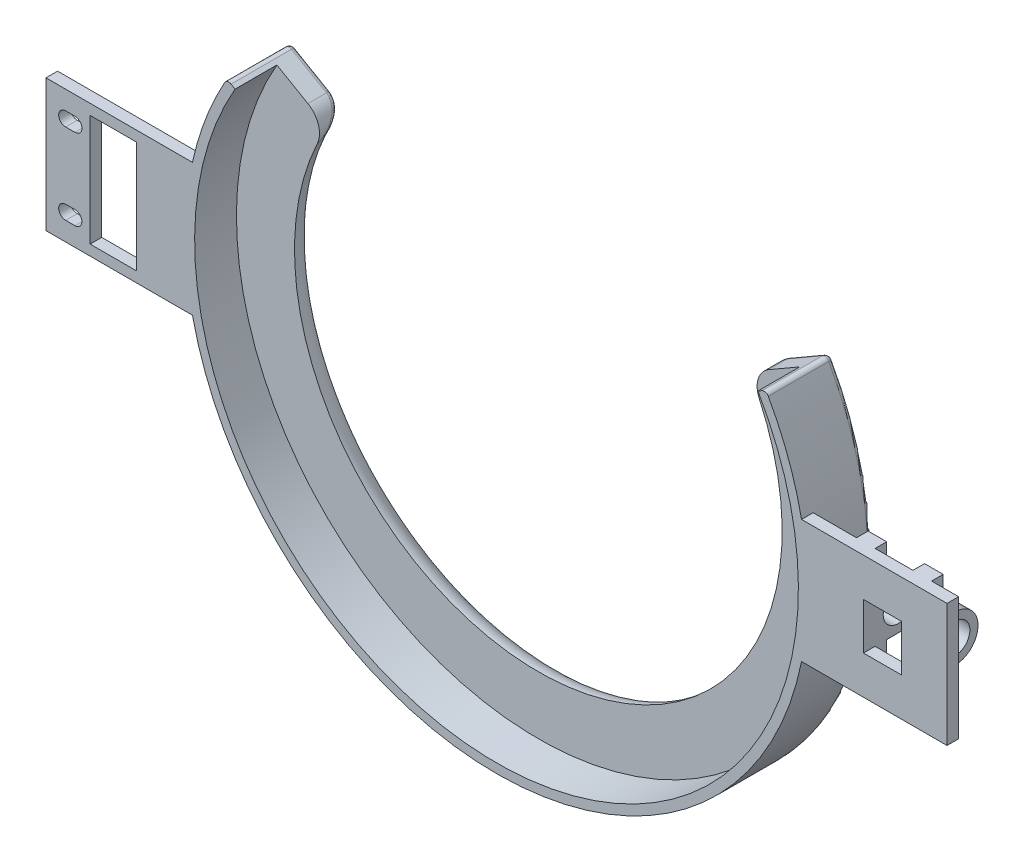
ISO-10303-21;
HEADER;
FILE_DESCRIPTION(('STEP AP214'),'2;1');
FILE_NAME('part.step','',(''),(''),'','','');
FILE_SCHEMA(('AUTOMOTIVE_DESIGN { 1 0 10303 214 1 1 1 1 }'));
ENDSEC;
DATA;
#1=APPLICATION_CONTEXT('core data for automotive mechanical design processes');
#2=APPLICATION_PROTOCOL_DEFINITION('international standard','automotive_design',2000,#1);
#3=PRODUCT_CONTEXT('',#1,'mechanical');
#4=PRODUCT('Part','Part','',(#3));
#5=PRODUCT_RELATED_PRODUCT_CATEGORY('part','',(#4));
#6=PRODUCT_DEFINITION_FORMATION('','',#4);
#7=PRODUCT_DEFINITION_CONTEXT('part definition',#1,'design');
#8=PRODUCT_DEFINITION('design','',#6,#7);
#9=PRODUCT_DEFINITION_SHAPE('','',#8);
#10=(LENGTH_UNIT() NAMED_UNIT(*) SI_UNIT(.MILLI.,.METRE.));
#11=(NAMED_UNIT(*) PLANE_ANGLE_UNIT() SI_UNIT($,.RADIAN.));
#12=(NAMED_UNIT(*) SI_UNIT($,.STERADIAN.) SOLID_ANGLE_UNIT());
#13=UNCERTAINTY_MEASURE_WITH_UNIT(LENGTH_MEASURE(1.E-05),#10,'distance_accuracy_value','');
#14=(GEOMETRIC_REPRESENTATION_CONTEXT(3) GLOBAL_UNCERTAINTY_ASSIGNED_CONTEXT((#13)) GLOBAL_UNIT_ASSIGNED_CONTEXT((#10,
#11,#12)) REPRESENTATION_CONTEXT('',''));
#15=CARTESIAN_POINT('',(0.,0.,0.));
#16=DIRECTION('',(0.,0.,1.));
#17=DIRECTION('',(1.,0.,0.));
#18=AXIS2_PLACEMENT_3D('',#15,#16,#17);
#19=CARTESIAN_POINT('',(79.01,13.25,1.5));
#20=DIRECTION('',(-1.,0.,0.));
#21=DIRECTION('',(0.,0.,1.));
#22=AXIS2_PLACEMENT_3D('',#19,#20,#21);
#23=PLANE('',#22);
#24=CARTESIAN_POINT('',(79.01,0.,6.5));
#25=DIRECTION('',(-1.,0.,0.));
#26=DIRECTION('',(0.,0.,1.));
#27=AXIS2_PLACEMENT_3D('',#24,#25,#26);
#28=CIRCLE('',#27,3.25);
#29=CARTESIAN_POINT('',(79.01,0.,9.75));
#30=VERTEX_POINT('',#29);
#31=EDGE_CURVE('E698',#30,#30,#28,.T.);
#32=ORIENTED_EDGE('',*,*,#31,.T.);
#33=EDGE_LOOP('',(#32));
#34=FACE_BOUND('',#33,.T.);
#35=DIRECTION('',(0.,0.,-1.));
#36=VECTOR('',#35,1.);
#37=CARTESIAN_POINT('',(79.01,-5.00000000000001,1.5));
#38=LINE('',#37,#36);
#39=CARTESIAN_POINT('',(79.01,-5.00000000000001,9.));
#40=VERTEX_POINT('',#39);
#41=CARTESIAN_POINT('',(79.01,-5.00000000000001,6.5));
#42=VERTEX_POINT('',#41);
#43=EDGE_CURVE('E580',#40,#42,#38,.T.);
#44=ORIENTED_EDGE('',*,*,#43,.T.);
#45=CARTESIAN_POINT('',(79.01,0.,6.5));
#46=DIRECTION('',(-1.,0.,0.));
#47=DIRECTION('',(0.,0.,1.));
#48=AXIS2_PLACEMENT_3D('',#45,#46,#47);
#49=CIRCLE('',#48,5.);
#50=CARTESIAN_POINT('',(79.01,5.,6.5));
#51=VERTEX_POINT('',#50);
#52=EDGE_CURVE('E614',#51,#42,#49,.T.);
#53=ORIENTED_EDGE('',*,*,#52,.F.);
#54=DIRECTION('',(0.,0.,-1.));
#55=VECTOR('',#54,1.);
#56=CARTESIAN_POINT('',(79.01,5.,1.5));
#57=LINE('',#56,#55);
#58=CARTESIAN_POINT('',(79.01,5.,9.));
#59=VERTEX_POINT('',#58);
#60=EDGE_CURVE('E628',#59,#51,#57,.T.);
#61=ORIENTED_EDGE('',*,*,#60,.F.);
#62=DIRECTION('',(0.,1.,0.));
#63=VECTOR('',#62,1.);
#64=CARTESIAN_POINT('',(79.01,13.25,9.));
#65=LINE('',#64,#63);
#66=CARTESIAN_POINT('',(79.01,13.25,9.));
#67=VERTEX_POINT('',#66);
#68=EDGE_CURVE('E621',#59,#67,#65,.T.);
#69=ORIENTED_EDGE('',*,*,#68,.T.);
#70=DIRECTION('',(0.,0.,1.));
#71=VECTOR('',#70,1.);
#72=CARTESIAN_POINT('',(79.01,13.25,1.5));
#73=LINE('',#72,#71);
#74=CARTESIAN_POINT('',(79.01,13.25,11.5));
#75=VERTEX_POINT('',#74);
#76=EDGE_CURVE('E732',#67,#75,#73,.T.);
#77=ORIENTED_EDGE('',*,*,#76,.T.);
#78=DIRECTION('',(0.,-1.,0.));
#79=VECTOR('',#78,1.);
#80=CARTESIAN_POINT('',(79.01,13.25,11.5));
#81=LINE('',#80,#79);
#82=CARTESIAN_POINT('',(79.01,5.,11.5));
#83=VERTEX_POINT('',#82);
#84=EDGE_CURVE('E724',#75,#83,#81,.T.);
#85=ORIENTED_EDGE('',*,*,#84,.T.);
#86=DIRECTION('',(0.,0.,-1.));
#87=VECTOR('',#86,1.);
#88=CARTESIAN_POINT('',(79.01,5.,13.));
#89=LINE('',#88,#87);
#90=CARTESIAN_POINT('',(79.01,5.,14.));
#91=VERTEX_POINT('',#90);
#92=EDGE_CURVE('E682',#91,#83,#89,.T.);
#93=ORIENTED_EDGE('',*,*,#92,.F.);
#94=DIRECTION('',(0.,-1.,0.));
#95=VECTOR('',#94,1.);
#96=CARTESIAN_POINT('',(79.01,-5.,14.));
#97=LINE('',#96,#95);
#98=CARTESIAN_POINT('',(79.01,-5.,14.));
#99=VERTEX_POINT('',#98);
#100=EDGE_CURVE('E480',#91,#99,#97,.T.);
#101=ORIENTED_EDGE('',*,*,#100,.T.);
#102=DIRECTION('',(0.,0.,-1.));
#103=VECTOR('',#102,1.);
#104=CARTESIAN_POINT('',(79.01,-5.,13.));
#105=LINE('',#104,#103);
#106=CARTESIAN_POINT('',(79.01,-5.,11.5));
#107=VERTEX_POINT('',#106);
#108=EDGE_CURVE('E685',#99,#107,#105,.T.);
#109=ORIENTED_EDGE('',*,*,#108,.T.);
#110=CARTESIAN_POINT('',(79.01,-13.25,11.5));
#111=VERTEX_POINT('',#110);
#112=EDGE_CURVE('E723',#107,#111,#81,.T.);
#113=ORIENTED_EDGE('',*,*,#112,.T.);
#114=DIRECTION('',(0.,0.,1.));
#115=VECTOR('',#114,1.);
#116=CARTESIAN_POINT('',(79.01,-13.25,1.5));
#117=LINE('',#116,#115);
#118=CARTESIAN_POINT('',(79.01,-13.25,9.));
#119=VERTEX_POINT('',#118);
#120=EDGE_CURVE('E741',#119,#111,#117,.T.);
#121=ORIENTED_EDGE('',*,*,#120,.F.);
#122=DIRECTION('',(0.,1.,0.));
#123=VECTOR('',#122,1.);
#124=CARTESIAN_POINT('',(79.01,13.25,9.));
#125=LINE('',#124,#123);
#126=EDGE_CURVE('E572',#119,#40,#125,.T.);
#127=ORIENTED_EDGE('',*,*,#126,.T.);
#128=EDGE_LOOP('',(#44,#53,#61,#69,#77,#85,#93,#101,#109,#113,#121,#127));
#129=FACE_BOUND('',#128,.T.);
#130=ADVANCED_FACE('F73',(#34,#129),#23,.F.);
#131=CARTESIAN_POINT('',(75.01,13.25,1.5));
#132=DIRECTION('',(1.,0.,0.));
#133=DIRECTION('',(0.,0.,-1.));
#134=AXIS2_PLACEMENT_3D('',#131,#132,#133);
#135=PLANE('',#134);
#136=CARTESIAN_POINT('',(75.01,0.,6.5));
#137=DIRECTION('',(1.,0.,0.));
#138=DIRECTION('',(0.,0.,-1.));
#139=AXIS2_PLACEMENT_3D('',#136,#137,#138);
#140=CIRCLE('',#139,3.25);
#141=CARTESIAN_POINT('',(75.01,0.,3.25));
#142=VERTEX_POINT('',#141);
#143=EDGE_CURVE('E694',#142,#142,#140,.T.);
#144=ORIENTED_EDGE('',*,*,#143,.T.);
#145=EDGE_LOOP('',(#144));
#146=FACE_BOUND('',#145,.T.);
#147=CARTESIAN_POINT('',(75.01,0.,6.5));
#148=DIRECTION('',(1.,0.,0.));
#149=DIRECTION('',(0.,0.,-1.));
#150=AXIS2_PLACEMENT_3D('',#147,#148,#149);
#151=CIRCLE('',#150,5.);
#152=CARTESIAN_POINT('',(75.01,-5.00000000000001,6.5));
#153=VERTEX_POINT('',#152);
#154=CARTESIAN_POINT('',(75.01,5.,6.5));
#155=VERTEX_POINT('',#154);
#156=EDGE_CURVE('E611',#153,#155,#151,.T.);
#157=ORIENTED_EDGE('',*,*,#156,.F.);
#158=DIRECTION('',(0.,0.,1.));
#159=VECTOR('',#158,1.);
#160=CARTESIAN_POINT('',(75.01,-5.00000000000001,1.5));
#161=LINE('',#160,#159);
#162=CARTESIAN_POINT('',(75.01,-5.00000000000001,9.));
#163=VERTEX_POINT('',#162);
#164=EDGE_CURVE('E576',#153,#163,#161,.T.);
#165=ORIENTED_EDGE('',*,*,#164,.T.);
#166=DIRECTION('',(0.,-1.,0.));
#167=VECTOR('',#166,1.);
#168=CARTESIAN_POINT('',(75.01,13.25,9.));
#169=LINE('',#168,#167);
#170=CARTESIAN_POINT('',(75.01,-13.25,9.));
#171=VERTEX_POINT('',#170);
#172=EDGE_CURVE('E568',#163,#171,#169,.T.);
#173=ORIENTED_EDGE('',*,*,#172,.T.);
#174=DIRECTION('',(0.,0.,1.));
#175=VECTOR('',#174,1.);
#176=CARTESIAN_POINT('',(75.01,-13.25,1.5));
#177=LINE('',#176,#175);
#178=CARTESIAN_POINT('',(75.0099999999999,-13.25,11.5));
#179=VERTEX_POINT('',#178);
#180=EDGE_CURVE('E738',#171,#179,#177,.T.);
#181=ORIENTED_EDGE('',*,*,#180,.T.);
#182=DIRECTION('',(0.,1.,0.));
#183=VECTOR('',#182,1.);
#184=CARTESIAN_POINT('',(75.01,13.25,11.5));
#185=LINE('',#184,#183);
#186=CARTESIAN_POINT('',(75.01,13.25,11.5));
#187=VERTEX_POINT('',#186);
#188=EDGE_CURVE('E728',#179,#187,#185,.T.);
#189=ORIENTED_EDGE('',*,*,#188,.T.);
#190=DIRECTION('',(0.,0.,1.));
#191=VECTOR('',#190,1.);
#192=CARTESIAN_POINT('',(75.01,13.25,1.5));
#193=LINE('',#192,#191);
#194=CARTESIAN_POINT('',(75.01,13.25,9.));
#195=VERTEX_POINT('',#194);
#196=EDGE_CURVE('E735',#195,#187,#193,.T.);
#197=ORIENTED_EDGE('',*,*,#196,.F.);
#198=DIRECTION('',(0.,-1.,0.));
#199=VECTOR('',#198,1.);
#200=CARTESIAN_POINT('',(75.01,13.25,9.));
#201=LINE('',#200,#199);
#202=CARTESIAN_POINT('',(75.01,5.,9.));
#203=VERTEX_POINT('',#202);
#204=EDGE_CURVE('E617',#195,#203,#201,.T.);
#205=ORIENTED_EDGE('',*,*,#204,.T.);
#206=DIRECTION('',(0.,0.,1.));
#207=VECTOR('',#206,1.);
#208=CARTESIAN_POINT('',(75.01,5.,1.5));
#209=LINE('',#208,#207);
#210=EDGE_CURVE('E625',#155,#203,#209,.T.);
#211=ORIENTED_EDGE('',*,*,#210,.F.);
#212=EDGE_LOOP('',(#157,#165,#173,#181,#189,#197,#205,#211));
#213=FACE_BOUND('',#212,.T.);
#214=ADVANCED_FACE('F1085',(#146,#213),#135,.F.);
#215=CARTESIAN_POINT('',(91.17,13.25,1.5));
#216=DIRECTION('',(-1.,0.,0.));
#217=DIRECTION('',(0.,0.,1.));
#218=AXIS2_PLACEMENT_3D('',#215,#216,#217);
#219=PLANE('',#218);
#220=CARTESIAN_POINT('',(91.17,0.,6.5));
#221=DIRECTION('',(1.,0.,0.));
#222=DIRECTION('',(0.,0.,-1.));
#223=AXIS2_PLACEMENT_3D('',#220,#221,#222);
#224=CIRCLE('',#223,3.25);
#225=CARTESIAN_POINT('',(91.17,0.,3.25));
#226=VERTEX_POINT('',#225);
#227=EDGE_CURVE('E681',#226,#226,#224,.T.);
#228=ORIENTED_EDGE('',*,*,#227,.F.);
#229=EDGE_LOOP('',(#228));
#230=FACE_BOUND('',#229,.T.);
#231=DIRECTION('',(0.,0.,1.));
#232=VECTOR('',#231,1.);
#233=CARTESIAN_POINT('',(91.17,-5.00000000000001,0.));
#234=LINE('',#233,#232);
#235=CARTESIAN_POINT('',(91.17,-5.00000000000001,6.5));
#236=VERTEX_POINT('',#235);
#237=CARTESIAN_POINT('',(91.17,-5.00000000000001,9.));
#238=VERTEX_POINT('',#237);
#239=EDGE_CURVE('E548',#236,#238,#234,.T.);
#240=ORIENTED_EDGE('',*,*,#239,.F.);
#241=CARTESIAN_POINT('',(91.17,0.,6.5));
#242=DIRECTION('',(1.,0.,0.));
#243=DIRECTION('',(0.,0.,-1.));
#244=AXIS2_PLACEMENT_3D('',#241,#242,#243);
#245=CIRCLE('',#244,5.);
#246=CARTESIAN_POINT('',(91.17,5.,6.5));
#247=VERTEX_POINT('',#246);
#248=EDGE_CURVE('E584',#236,#247,#245,.T.);
#249=ORIENTED_EDGE('',*,*,#248,.T.);
#250=DIRECTION('',(0.,0.,1.));
#251=VECTOR('',#250,1.);
#252=CARTESIAN_POINT('',(91.17,5.,0.));
#253=LINE('',#252,#251);
#254=CARTESIAN_POINT('',(91.17,5.,9.));
#255=VERTEX_POINT('',#254);
#256=EDGE_CURVE('E592',#247,#255,#253,.T.);
#257=ORIENTED_EDGE('',*,*,#256,.T.);
#258=DIRECTION('',(0.,-1.,0.));
#259=VECTOR('',#258,1.);
#260=CARTESIAN_POINT('',(91.17,0.,9.));
#261=LINE('',#260,#259);
#262=CARTESIAN_POINT('',(91.17,13.25,9.));
#263=VERTEX_POINT('',#262);
#264=EDGE_CURVE('E588',#263,#255,#261,.T.);
#265=ORIENTED_EDGE('',*,*,#264,.F.);
#266=DIRECTION('',(0.,0.,1.));
#267=VECTOR('',#266,1.);
#268=CARTESIAN_POINT('',(91.17,13.25,1.5));
#269=LINE('',#268,#267);
#270=CARTESIAN_POINT('',(91.17,13.25,11.5));
#271=VERTEX_POINT('',#270);
#272=EDGE_CURVE('E711',#263,#271,#269,.T.);
#273=ORIENTED_EDGE('',*,*,#272,.T.);
#274=DIRECTION('',(0.,-1.,0.));
#275=VECTOR('',#274,1.);
#276=CARTESIAN_POINT('',(91.17,13.25,11.5));
#277=LINE('',#276,#275);
#278=CARTESIAN_POINT('',(91.1699999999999,-13.25,11.5));
#279=VERTEX_POINT('',#278);
#280=EDGE_CURVE('E702',#271,#279,#277,.T.);
#281=ORIENTED_EDGE('',*,*,#280,.T.);
#282=DIRECTION('',(0.,0.,1.));
#283=VECTOR('',#282,1.);
#284=CARTESIAN_POINT('',(91.17,-13.25,1.5));
#285=LINE('',#284,#283);
#286=CARTESIAN_POINT('',(91.17,-13.25,9.));
#287=VERTEX_POINT('',#286);
#288=EDGE_CURVE('E720',#287,#279,#285,.T.);
#289=ORIENTED_EDGE('',*,*,#288,.F.);
#290=DIRECTION('',(0.,-1.,0.));
#291=VECTOR('',#290,1.);
#292=CARTESIAN_POINT('',(91.17,0.,9.));
#293=LINE('',#292,#291);
#294=EDGE_CURVE('E552',#238,#287,#293,.T.);
#295=ORIENTED_EDGE('',*,*,#294,.F.);
#296=EDGE_LOOP('',(#240,#249,#257,#265,#273,#281,#289,#295));
#297=FACE_BOUND('',#296,.T.);
#298=ADVANCED_FACE('F1148',(#230,#297),#219,.F.);
#299=CARTESIAN_POINT('',(87.17,13.25,1.5));
#300=DIRECTION('',(1.,0.,0.));
#301=DIRECTION('',(0.,0.,-1.));
#302=AXIS2_PLACEMENT_3D('',#299,#300,#301);
#303=PLANE('',#302);
#304=CARTESIAN_POINT('',(87.17,0.,6.5));
#305=DIRECTION('',(1.,0.,0.));
#306=DIRECTION('',(0.,0.,-1.));
#307=AXIS2_PLACEMENT_3D('',#304,#305,#306);
#308=CIRCLE('',#307,3.25);
#309=CARTESIAN_POINT('',(87.17,0.,3.25));
#310=VERTEX_POINT('',#309);
#311=EDGE_CURVE('E693',#310,#310,#308,.T.);
#312=ORIENTED_EDGE('',*,*,#311,.T.);
#313=EDGE_LOOP('',(#312));
#314=FACE_BOUND('',#313,.T.);
#315=CARTESIAN_POINT('',(87.17,0.,6.5));
#316=DIRECTION('',(1.,0.,0.));
#317=DIRECTION('',(0.,0.,-1.));
#318=AXIS2_PLACEMENT_3D('',#315,#316,#317);
#319=CIRCLE('',#318,5.);
#320=CARTESIAN_POINT('',(87.17,-5.00000000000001,6.5));
#321=VERTEX_POINT('',#320);
#322=CARTESIAN_POINT('',(87.17,5.,6.5));
#323=VERTEX_POINT('',#322);
#324=EDGE_CURVE('E608',#321,#323,#319,.T.);
#325=ORIENTED_EDGE('',*,*,#324,.F.);
#326=DIRECTION('',(0.,0.,1.));
#327=VECTOR('',#326,1.);
#328=CARTESIAN_POINT('',(87.17,-5.00000000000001,1.5));
#329=LINE('',#328,#327);
#330=CARTESIAN_POINT('',(87.17,-5.00000000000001,9.));
#331=VERTEX_POINT('',#330);
#332=EDGE_CURVE('E12',#321,#331,#329,.T.);
#333=ORIENTED_EDGE('',*,*,#332,.T.);
#334=DIRECTION('',(0.,-1.,0.));
#335=VECTOR('',#334,1.);
#336=CARTESIAN_POINT('',(87.17,13.25,9.));
#337=LINE('',#336,#335);
#338=CARTESIAN_POINT('',(87.17,-13.25,9.));
#339=VERTEX_POINT('',#338);
#340=EDGE_CURVE('E564',#331,#339,#337,.T.);
#341=ORIENTED_EDGE('',*,*,#340,.T.);
#342=DIRECTION('',(0.,0.,1.));
#343=VECTOR('',#342,1.);
#344=CARTESIAN_POINT('',(87.17,-13.25,1.5));
#345=LINE('',#344,#343);
#346=CARTESIAN_POINT('',(87.1699999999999,-13.25,11.5));
#347=VERTEX_POINT('',#346);
#348=EDGE_CURVE('E717',#339,#347,#345,.T.);
#349=ORIENTED_EDGE('',*,*,#348,.T.);
#350=DIRECTION('',(0.,1.,0.));
#351=VECTOR('',#350,1.);
#352=CARTESIAN_POINT('',(87.17,13.25,11.5));
#353=LINE('',#352,#351);
#354=CARTESIAN_POINT('',(87.1699999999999,-5.,11.5));
#355=VERTEX_POINT('',#354);
#356=EDGE_CURVE('E707',#347,#355,#353,.T.);
#357=ORIENTED_EDGE('',*,*,#356,.T.);
#358=DIRECTION('',(0.,0.,-1.));
#359=VECTOR('',#358,1.);
#360=CARTESIAN_POINT('',(87.1699999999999,-5.,13.));
#361=LINE('',#360,#359);
#362=CARTESIAN_POINT('',(87.1699999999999,-5.,14.));
#363=VERTEX_POINT('',#362);
#364=EDGE_CURVE('E676',#363,#355,#361,.T.);
#365=ORIENTED_EDGE('',*,*,#364,.F.);
#366=DIRECTION('',(0.,1.,0.));
#367=VECTOR('',#366,1.);
#368=CARTESIAN_POINT('',(87.1699999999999,5.,14.));
#369=LINE('',#368,#367);
#370=CARTESIAN_POINT('',(87.1699999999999,5.,14.));
#371=VERTEX_POINT('',#370);
#372=EDGE_CURVE('E488',#363,#371,#369,.T.);
#373=ORIENTED_EDGE('',*,*,#372,.T.);
#374=DIRECTION('',(0.,0.,-1.));
#375=VECTOR('',#374,1.);
#376=CARTESIAN_POINT('',(87.1699999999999,5.,13.));
#377=LINE('',#376,#375);
#378=CARTESIAN_POINT('',(87.17,5.,11.5));
#379=VERTEX_POINT('',#378);
#380=EDGE_CURVE('E677',#371,#379,#377,.T.);
#381=ORIENTED_EDGE('',*,*,#380,.T.);
#382=CARTESIAN_POINT('',(87.1699999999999,13.25,11.5));
#383=VERTEX_POINT('',#382);
#384=EDGE_CURVE('E706',#379,#383,#353,.T.);
#385=ORIENTED_EDGE('',*,*,#384,.T.);
#386=DIRECTION('',(0.,0.,1.));
#387=VECTOR('',#386,1.);
#388=CARTESIAN_POINT('',(87.17,13.25,1.5));
#389=LINE('',#388,#387);
#390=CARTESIAN_POINT('',(87.17,13.25,9.));
#391=VERTEX_POINT('',#390);
#392=EDGE_CURVE('E714',#391,#383,#389,.T.);
#393=ORIENTED_EDGE('',*,*,#392,.F.);
#394=DIRECTION('',(0.,-1.,0.));
#395=VECTOR('',#394,1.);
#396=CARTESIAN_POINT('',(87.17,13.25,9.));
#397=LINE('',#396,#395);
#398=CARTESIAN_POINT('',(87.17,5.,9.));
#399=VERTEX_POINT('',#398);
#400=EDGE_CURVE('E1040',#391,#399,#397,.T.);
#401=ORIENTED_EDGE('',*,*,#400,.T.);
#402=DIRECTION('',(0.,0.,1.));
#403=VECTOR('',#402,1.);
#404=CARTESIAN_POINT('',(87.17,5.,1.5));
#405=LINE('',#404,#403);
#406=EDGE_CURVE('E1045',#323,#399,#405,.T.);
#407=ORIENTED_EDGE('',*,*,#406,.F.);
#408=EDGE_LOOP('',(#325,#333,#341,#349,#357,#365,#373,#381,#385,#393,#401,#407));
#409=FACE_BOUND('',#408,.T.);
#410=ADVANCED_FACE('F1061',(#314,#409),#303,.F.);
#411=CARTESIAN_POINT('',(0.,0.,15.));
#412=DIRECTION('',(0.,0.,-1.));
#413=DIRECTION('',(-1.,0.,0.));
#414=AXIS2_PLACEMENT_3D('',#411,#412,#413);
#415=CYLINDRICAL_SURFACE('',#414,67.);
#416=DIRECTION('',(0.,0.,-1.));
#417=VECTOR('',#416,1.);
#418=CARTESIAN_POINT('',(-65.4670718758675,-14.25,15.));
#419=LINE('',#418,#417);
#420=CARTESIAN_POINT('',(-65.4670718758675,-14.25,14.));
#421=VERTEX_POINT('',#420);
#422=CARTESIAN_POINT('',(-65.4670718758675,-14.25,11.5));
#423=VERTEX_POINT('',#422);
#424=EDGE_CURVE('E639',#421,#423,#419,.T.);
#425=ORIENTED_EDGE('',*,*,#424,.T.);
#426=CARTESIAN_POINT('',(0.,0.,11.5));
#427=DIRECTION('',(0.,0.,-1.));
#428=DIRECTION('',(-1.,0.,0.));
#429=AXIS2_PLACEMENT_3D('',#426,#427,#428);
#430=CIRCLE('',#429,67.);
#431=CARTESIAN_POINT('',(-65.4670718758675,14.25,11.5));
#432=VERTEX_POINT('',#431);
#433=EDGE_CURVE('E90',#423,#432,#430,.T.);
#434=ORIENTED_EDGE('',*,*,#433,.T.);
#435=DIRECTION('',(0.,0.,-1.));
#436=VECTOR('',#435,1.);
#437=CARTESIAN_POINT('',(-65.4670718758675,14.25,15.));
#438=LINE('',#437,#436);
#439=CARTESIAN_POINT('',(-65.4670718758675,14.25,14.));
#440=VERTEX_POINT('',#439);
#441=EDGE_CURVE('E1037',#432,#440,#438,.F.);
#442=ORIENTED_EDGE('',*,*,#441,.T.);
#443=CARTESIAN_POINT('',(0.,0.,14.));
#444=DIRECTION('',(0.,0.,1.));
#445=DIRECTION('',(1.,0.,0.));
#446=AXIS2_PLACEMENT_3D('',#443,#444,#445);
#447=CIRCLE('',#446,67.);
#448=CARTESIAN_POINT('',(-58.5246172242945,32.6170075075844,14.));
#449=VERTEX_POINT('',#448);
#450=EDGE_CURVE('E540',#449,#440,#447,.T.);
#451=ORIENTED_EDGE('',*,*,#450,.F.);
#452=DIRECTION('',(0.,0.,-1.));
#453=VECTOR('',#452,1.);
#454=CARTESIAN_POINT('',(-58.5246172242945,32.6170075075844,15.));
#455=LINE('',#454,#453);
#456=CARTESIAN_POINT('',(-58.5246172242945,32.6170075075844,1.));
#457=VERTEX_POINT('',#456);
#458=EDGE_CURVE('E879',#449,#457,#455,.T.);
#459=ORIENTED_EDGE('',*,*,#458,.T.);
#460=CARTESIAN_POINT('',(0.,0.,1.));
#461=DIRECTION('',(0.,0.,1.));
#462=DIRECTION('',(1.,0.,0.));
#463=AXIS2_PLACEMENT_3D('',#460,#461,#462);
#464=CIRCLE('',#463,67.);
#465=CARTESIAN_POINT('',(58.5246172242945,32.6170075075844,1.));
#466=VERTEX_POINT('',#465);
#467=EDGE_CURVE('E873',#457,#466,#464,.T.);
#468=ORIENTED_EDGE('',*,*,#467,.T.);
#469=DIRECTION('',(0.,0.,-1.));
#470=VECTOR('',#469,1.);
#471=CARTESIAN_POINT('',(58.5246172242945,32.6170075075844,15.));
#472=LINE('',#471,#470);
#473=CARTESIAN_POINT('',(58.5246172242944,32.6170075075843,14.));
#474=VERTEX_POINT('',#473);
#475=EDGE_CURVE('E876',#466,#474,#472,.F.);
#476=ORIENTED_EDGE('',*,*,#475,.T.);
#477=CARTESIAN_POINT('',(0.,0.,14.));
#478=DIRECTION('',(0.,0.,1.));
#479=DIRECTION('',(1.,0.,0.));
#480=AXIS2_PLACEMENT_3D('',#477,#478,#479);
#481=CIRCLE('',#480,67.);
#482=CARTESIAN_POINT('',(65.6767652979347,13.25,14.));
#483=VERTEX_POINT('',#482);
#484=EDGE_CURVE('E516',#483,#474,#481,.T.);
#485=ORIENTED_EDGE('',*,*,#484,.F.);
#486=DIRECTION('',(0.,0.,-1.));
#487=VECTOR('',#486,1.);
#488=CARTESIAN_POINT('',(65.6767652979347,13.25,15.));
#489=LINE('',#488,#487);
#490=CARTESIAN_POINT('',(65.6767652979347,13.25,11.5));
#491=VERTEX_POINT('',#490);
#492=EDGE_CURVE('E844',#483,#491,#489,.T.);
#493=ORIENTED_EDGE('',*,*,#492,.T.);
#494=CARTESIAN_POINT('',(65.6767652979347,-13.25,11.5));
#495=VERTEX_POINT('',#494);
#496=EDGE_CURVE('E850',#491,#495,#430,.T.);
#497=ORIENTED_EDGE('',*,*,#496,.T.);
#498=DIRECTION('',(0.,0.,-1.));
#499=VECTOR('',#498,1.);
#500=CARTESIAN_POINT('',(65.6767652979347,-13.25,15.));
#501=LINE('',#500,#499);
#502=CARTESIAN_POINT('',(65.6767652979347,-13.25,14.));
#503=VERTEX_POINT('',#502);
#504=EDGE_CURVE('E841',#495,#503,#501,.F.);
#505=ORIENTED_EDGE('',*,*,#504,.T.);
#506=CARTESIAN_POINT('',(0.,0.,14.));
#507=DIRECTION('',(0.,0.,1.));
#508=DIRECTION('',(1.,0.,0.));
#509=AXIS2_PLACEMENT_3D('',#506,#507,#508);
#510=CIRCLE('',#509,67.);
#511=EDGE_CURVE('E500',#421,#503,#510,.T.);
#512=ORIENTED_EDGE('',*,*,#511,.F.);
#513=EDGE_LOOP('',(#425,#434,#442,#451,#459,#468,#476,#485,#493,#497,#505,#512));
#514=FACE_BOUND('',#513,.T.);
#515=ADVANCED_FACE('F1169',(#514),#415,.T.);
#516=CARTESIAN_POINT('',(-97.,13.25,11.5));
#517=DIRECTION('',(0.,0.,-1.));
#518=DIRECTION('',(-1.,0.,0.));
#519=AXIS2_PLACEMENT_3D('',#516,#517,#518);
#520=PLANE('',#519);
#521=DIRECTION('',(-1.,0.,0.));
#522=VECTOR('',#521,1.);
#523=CARTESIAN_POINT('',(0.,-10.203867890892,11.5));
#524=LINE('',#523,#522);
#525=CARTESIAN_POINT('',(-90.7689792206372,-10.203867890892,11.5));
#526=VERTEX_POINT('',#525);
#527=CARTESIAN_POINT('',(-92.7689792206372,-10.203867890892,11.5));
#528=VERTEX_POINT('',#527);
#529=EDGE_CURVE('E745',#526,#528,#524,.T.);
#530=ORIENTED_EDGE('',*,*,#529,.F.);
#531=CARTESIAN_POINT('',(-90.7689792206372,-8.70386789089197,11.5));
#532=DIRECTION('',(0.,0.,-1.));
#533=DIRECTION('',(-1.,0.,0.));
#534=AXIS2_PLACEMENT_3D('',#531,#532,#533);
#535=CIRCLE('',#534,1.5);
#536=CARTESIAN_POINT('',(-90.7689792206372,-7.20386789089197,11.5));
#537=VERTEX_POINT('',#536);
#538=EDGE_CURVE('E757',#537,#526,#535,.T.);
#539=ORIENTED_EDGE('',*,*,#538,.F.);
#540=DIRECTION('',(-1.,0.,0.));
#541=VECTOR('',#540,1.);
#542=CARTESIAN_POINT('',(0.,-7.20386789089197,11.5));
#543=LINE('',#542,#541);
#544=CARTESIAN_POINT('',(-92.7689792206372,-7.20386789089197,11.5));
#545=VERTEX_POINT('',#544);
#546=EDGE_CURVE('E753',#537,#545,#543,.T.);
#547=ORIENTED_EDGE('',*,*,#546,.T.);
#548=CARTESIAN_POINT('',(-92.7689792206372,-8.70386789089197,11.5));
#549=DIRECTION('',(0.,0.,-1.));
#550=DIRECTION('',(-1.,0.,0.));
#551=AXIS2_PLACEMENT_3D('',#548,#549,#550);
#552=CIRCLE('',#551,1.5);
#553=EDGE_CURVE('E748',#528,#545,#552,.T.);
#554=ORIENTED_EDGE('',*,*,#553,.F.);
#555=EDGE_LOOP('',(#530,#539,#547,#554));
#556=FACE_BOUND('',#555,.T.);
#557=ORIENTED_EDGE('',*,*,#433,.F.);
#558=DIRECTION('',(1.,0.,0.));
#559=VECTOR('',#558,1.);
#560=CARTESIAN_POINT('',(-97.,-14.25,11.5));
#561=LINE('',#560,#559);
#562=CARTESIAN_POINT('',(-97.,-14.25,11.5));
#563=VERTEX_POINT('',#562);
#564=EDGE_CURVE('E635',#563,#423,#561,.T.);
#565=ORIENTED_EDGE('',*,*,#564,.F.);
#566=DIRECTION('',(0.,1.,0.));
#567=VECTOR('',#566,1.);
#568=CARTESIAN_POINT('',(-97.,13.25,11.5));
#569=LINE('',#568,#567);
#570=CARTESIAN_POINT('',(-97.,14.25,11.5));
#571=VERTEX_POINT('',#570);
#572=EDGE_CURVE('E818',#563,#571,#569,.T.);
#573=ORIENTED_EDGE('',*,*,#572,.T.);
#574=DIRECTION('',(-1.,0.,0.));
#575=VECTOR('',#574,1.);
#576=CARTESIAN_POINT('',(-97.,14.25,11.5));
#577=LINE('',#576,#575);
#578=EDGE_CURVE('E645',#432,#571,#577,.T.);
#579=ORIENTED_EDGE('',*,*,#578,.F.);
#580=EDGE_LOOP('',(#557,#565,#573,#579));
#581=FACE_BOUND('',#580,.T.);
#582=DIRECTION('',(-1.,0.,0.));
#583=VECTOR('',#582,1.);
#584=CARTESIAN_POINT('',(0.,10.203867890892,11.5));
#585=LINE('',#584,#583);
#586=CARTESIAN_POINT('',(-90.7689792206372,10.203867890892,11.5));
#587=VERTEX_POINT('',#586);
#588=CARTESIAN_POINT('',(-92.7689792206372,10.203867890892,11.5));
#589=VERTEX_POINT('',#588);
#590=EDGE_CURVE('E778',#587,#589,#585,.T.);
#591=ORIENTED_EDGE('',*,*,#590,.T.);
#592=CARTESIAN_POINT('',(-92.7689792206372,8.70386789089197,11.5));
#593=DIRECTION('',(0.,0.,-1.));
#594=DIRECTION('',(-1.,0.,0.));
#595=AXIS2_PLACEMENT_3D('',#592,#593,#594);
#596=CIRCLE('',#595,1.5);
#597=CARTESIAN_POINT('',(-92.7689792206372,7.20386789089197,11.5));
#598=VERTEX_POINT('',#597);
#599=EDGE_CURVE('E744',#589,#598,#596,.F.);
#600=ORIENTED_EDGE('',*,*,#599,.T.);
#601=DIRECTION('',(-1.,0.,0.));
#602=VECTOR('',#601,1.);
#603=CARTESIAN_POINT('',(0.,7.20386789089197,11.5));
#604=LINE('',#603,#602);
#605=CARTESIAN_POINT('',(-90.7689792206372,7.20386789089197,11.5));
#606=VERTEX_POINT('',#605);
#607=EDGE_CURVE('E786',#606,#598,#604,.T.);
#608=ORIENTED_EDGE('',*,*,#607,.F.);
#609=CARTESIAN_POINT('',(-90.7689792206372,8.70386789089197,11.5));
#610=DIRECTION('',(0.,0.,-1.));
#611=DIRECTION('',(-1.,0.,0.));
#612=AXIS2_PLACEMENT_3D('',#609,#610,#611);
#613=CIRCLE('',#612,1.5);
#614=EDGE_CURVE('E782',#606,#587,#613,.F.);
#615=ORIENTED_EDGE('',*,*,#614,.T.);
#616=EDGE_LOOP('',(#591,#600,#608,#615));
#617=FACE_BOUND('',#616,.T.);
#618=DIRECTION('',(-1.,0.,0.));
#619=VECTOR('',#618,1.);
#620=CARTESIAN_POINT('',(0.,12.,11.5));
#621=LINE('',#620,#619);
#622=CARTESIAN_POINT('',(-77.5,12.,11.5));
#623=VERTEX_POINT('',#622);
#624=CARTESIAN_POINT('',(-87.5,12.,11.5));
#625=VERTEX_POINT('',#624);
#626=EDGE_CURVE('E417',#623,#625,#621,.T.);
#627=ORIENTED_EDGE('',*,*,#626,.T.);
#628=DIRECTION('',(0.,-1.,0.));
#629=VECTOR('',#628,1.);
#630=CARTESIAN_POINT('',(-87.5,0.,11.5));
#631=LINE('',#630,#629);
#632=CARTESIAN_POINT('',(-87.5,-12.,11.5));
#633=VERTEX_POINT('',#632);
#634=EDGE_CURVE('E649',#625,#633,#631,.T.);
#635=ORIENTED_EDGE('',*,*,#634,.T.);
#636=DIRECTION('',(-1.,0.,0.));
#637=VECTOR('',#636,1.);
#638=CARTESIAN_POINT('',(0.,-12.,11.5));
#639=LINE('',#638,#637);
#640=CARTESIAN_POINT('',(-77.5,-12.,11.5));
#641=VERTEX_POINT('',#640);
#642=EDGE_CURVE('E658',#641,#633,#639,.T.);
#643=ORIENTED_EDGE('',*,*,#642,.F.);
#644=DIRECTION('',(0.,-1.,0.));
#645=VECTOR('',#644,1.);
#646=CARTESIAN_POINT('',(-77.5,0.,11.5));
#647=LINE('',#646,#645);
#648=EDGE_CURVE('E655',#623,#641,#647,.T.);
#649=ORIENTED_EDGE('',*,*,#648,.F.);
#650=EDGE_LOOP('',(#627,#635,#643,#649));
#651=FACE_BOUND('',#650,.T.);
#652=ADVANCED_FACE('F1298',(#556,#581,#617,#651),#520,.T.);
#653=DIRECTION('',(1.,0.,0.));
#654=VECTOR('',#653,1.);
#655=CARTESIAN_POINT('',(87.1699999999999,5.,11.5));
#656=LINE('',#655,#654);
#657=EDGE_CURVE('E673',#83,#379,#656,.T.);
#658=ORIENTED_EDGE('',*,*,#657,.F.);
#659=ORIENTED_EDGE('',*,*,#84,.F.);
#660=DIRECTION('',(1.,0.,0.));
#661=VECTOR('',#660,1.);
#662=CARTESIAN_POINT('',(-97.,13.25,11.5));
#663=LINE('',#662,#661);
#664=EDGE_CURVE('E835',#75,#383,#663,.T.);
#665=ORIENTED_EDGE('',*,*,#664,.T.);
#666=ORIENTED_EDGE('',*,*,#384,.F.);
#667=EDGE_LOOP('',(#658,#659,#665,#666));
#668=FACE_BOUND('',#667,.T.);
#669=ADVANCED_FACE('F1125',(#668),#520,.T.);
#670=DIRECTION('',(1.,0.,0.));
#671=VECTOR('',#670,1.);
#672=CARTESIAN_POINT('',(-97.,-13.25,11.5));
#673=LINE('',#672,#671);
#674=CARTESIAN_POINT('',(97.,-13.25,11.5));
#675=VERTEX_POINT('',#674);
#676=EDGE_CURVE('E821',#279,#675,#673,.T.);
#677=ORIENTED_EDGE('',*,*,#676,.F.);
#678=ORIENTED_EDGE('',*,*,#280,.F.);
#679=CARTESIAN_POINT('',(97.,13.25,11.5));
#680=VERTEX_POINT('',#679);
#681=EDGE_CURVE('E832',#271,#680,#663,.T.);
#682=ORIENTED_EDGE('',*,*,#681,.T.);
#683=DIRECTION('',(0.,1.,0.));
#684=VECTOR('',#683,1.);
#685=CARTESIAN_POINT('',(97.,13.25,11.5));
#686=LINE('',#685,#684);
#687=EDGE_CURVE('E826',#675,#680,#686,.T.);
#688=ORIENTED_EDGE('',*,*,#687,.F.);
#689=EDGE_LOOP('',(#677,#678,#682,#688));
#690=FACE_BOUND('',#689,.T.);
#691=ADVANCED_FACE('F1161',(#690),#520,.T.);
#692=DIRECTION('',(-1.,0.,0.));
#693=VECTOR('',#692,1.);
#694=CARTESIAN_POINT('',(87.1699999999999,-5.,11.5));
#695=LINE('',#694,#693);
#696=EDGE_CURVE('E665',#355,#107,#695,.T.);
#697=ORIENTED_EDGE('',*,*,#696,.F.);
#698=ORIENTED_EDGE('',*,*,#356,.F.);
#699=EDGE_CURVE('E840',#111,#347,#673,.T.);
#700=ORIENTED_EDGE('',*,*,#699,.F.);
#701=ORIENTED_EDGE('',*,*,#112,.F.);
#702=EDGE_LOOP('',(#697,#698,#700,#701));
#703=FACE_BOUND('',#702,.T.);
#704=ADVANCED_FACE('F1136',(#703),#520,.T.);
#705=EDGE_CURVE('E837',#491,#187,#663,.T.);
#706=ORIENTED_EDGE('',*,*,#705,.T.);
#707=ORIENTED_EDGE('',*,*,#188,.F.);
#708=EDGE_CURVE('E836',#495,#179,#673,.T.);
#709=ORIENTED_EDGE('',*,*,#708,.F.);
#710=ORIENTED_EDGE('',*,*,#496,.F.);
#711=EDGE_LOOP('',(#706,#707,#709,#710));
#712=FACE_BOUND('',#711,.T.);
#713=ADVANCED_FACE('F1081',(#712),#520,.T.);
#714=CARTESIAN_POINT('',(0.,0.,5.));
#715=DIRECTION('',(0.,0.,1.));
#716=DIRECTION('',(1.,0.,0.));
#717=AXIS2_PLACEMENT_3D('',#714,#715,#716);
#718=CYLINDRICAL_SURFACE('',#717,65.);
#719=DIRECTION('',(0.,0.,1.));
#720=VECTOR('',#719,1.);
#721=CARTESIAN_POINT('',(-56.2916512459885,32.5000000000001,5.));
#722=LINE('',#721,#720);
#723=CARTESIAN_POINT('',(-56.2916512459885,32.5000000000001,5.));
#724=VERTEX_POINT('',#723);
#725=CARTESIAN_POINT('',(-56.2916512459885,32.5000000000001,14.));
#726=VERTEX_POINT('',#725);
#727=EDGE_CURVE('E806',#724,#726,#722,.T.);
#728=ORIENTED_EDGE('',*,*,#727,.T.);
#729=CARTESIAN_POINT('',(0.,0.,14.));
#730=DIRECTION('',(0.,0.,-1.));
#731=DIRECTION('',(1.,0.,0.));
#732=AXIS2_PLACEMENT_3D('',#729,#730,#731);
#733=CIRCLE('',#732,65.);
#734=CARTESIAN_POINT('',(56.2916512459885,32.5000000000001,14.));
#735=VERTEX_POINT('',#734);
#736=EDGE_CURVE('E528',#735,#726,#733,.T.);
#737=ORIENTED_EDGE('',*,*,#736,.F.);
#738=DIRECTION('',(0.,0.,1.));
#739=VECTOR('',#738,1.);
#740=CARTESIAN_POINT('',(56.2916512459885,32.5000000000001,5.));
#741=LINE('',#740,#739);
#742=CARTESIAN_POINT('',(56.2916512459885,32.5000000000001,5.));
#743=VERTEX_POINT('',#742);
#744=EDGE_CURVE('E813',#735,#743,#741,.F.);
#745=ORIENTED_EDGE('',*,*,#744,.T.);
#746=CARTESIAN_POINT('',(0.,0.,5.));
#747=DIRECTION('',(0.,0.,1.));
#748=DIRECTION('',(1.,0.,0.));
#749=AXIS2_PLACEMENT_3D('',#746,#747,#748);
#750=CIRCLE('',#749,65.);
#751=EDGE_CURVE('E851',#724,#743,#750,.T.);
#752=ORIENTED_EDGE('',*,*,#751,.F.);
#753=EDGE_LOOP('',(#728,#737,#745,#752));
#754=FACE_BOUND('',#753,.T.);
#755=ADVANCED_FACE('F1252',(#754),#718,.F.);
#756=CARTESIAN_POINT('',(0.,0.,0.));
#757=DIRECTION('',(0.,0.,1.));
#758=DIRECTION('',(1.,0.,0.));
#759=AXIS2_PLACEMENT_3D('',#756,#757,#758);
#760=PLANE('',#759);
#761=DIRECTION('',(-0.866025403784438,0.500000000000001,0.));
#762=VECTOR('',#761,1.);
#763=CARTESIAN_POINT('',(-0.500000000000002,-0.866025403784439,0.));
#764=LINE('',#763,#762);
#765=CARTESIAN_POINT('',(-57.6511154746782,32.1301865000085,0.));
#766=VERTEX_POINT('',#765);
#767=CARTESIAN_POINT('',(-50.2889294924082,27.8796264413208,0.));
#768=VERTEX_POINT('',#767);
#769=EDGE_CURVE('E869',#766,#768,#764,.F.);
#770=ORIENTED_EDGE('',*,*,#769,.T.);
#771=CARTESIAN_POINT('',(0.,0.,0.));
#772=DIRECTION('',(0.,0.,1.));
#773=DIRECTION('',(1.,0.,0.));
#774=AXIS2_PLACEMENT_3D('',#771,#772,#773);
#775=CIRCLE('',#774,57.5);
#776=CARTESIAN_POINT('',(50.2889294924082,27.8796264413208,0.));
#777=VERTEX_POINT('',#776);
#778=EDGE_CURVE('E1183',#768,#777,#775,.T.);
#779=ORIENTED_EDGE('',*,*,#778,.T.);
#780=DIRECTION('',(-0.866025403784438,-0.500000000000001,0.));
#781=VECTOR('',#780,1.);
#782=CARTESIAN_POINT('',(0.500000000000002,-0.866025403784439,0.));
#783=LINE('',#782,#781);
#784=CARTESIAN_POINT('',(57.6511154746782,32.1301865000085,0.));
#785=VERTEX_POINT('',#784);
#786=EDGE_CURVE('E863',#777,#785,#783,.F.);
#787=ORIENTED_EDGE('',*,*,#786,.T.);
#788=CARTESIAN_POINT('',(0.,0.,0.));
#789=DIRECTION('',(0.,0.,1.));
#790=DIRECTION('',(1.,0.,0.));
#791=AXIS2_PLACEMENT_3D('',#788,#789,#790);
#792=CIRCLE('',#791,66.);
#793=EDGE_CURVE('E897',#785,#766,#792,.F.);
#794=ORIENTED_EDGE('',*,*,#793,.T.);
#795=EDGE_LOOP('',(#770,#779,#787,#794));
#796=FACE_BOUND('',#795,.T.);
#797=ADVANCED_FACE('F1488',(#796),#760,.F.);
#798=CARTESIAN_POINT('',(0.,0.,5.));
#799=DIRECTION('',(0.,0.,1.));
#800=DIRECTION('',(1.,0.,0.));
#801=AXIS2_PLACEMENT_3D('',#798,#799,#800);
#802=PLANE('',#801);
#803=DIRECTION('',(0.866025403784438,0.500000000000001,0.));
#804=VECTOR('',#803,1.);
#805=CARTESIAN_POINT('',(0.,0.,5.));
#806=LINE('',#805,#804);
#807=CARTESIAN_POINT('',(49.607837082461,28.6410980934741,5.));
#808=VERTEX_POINT('',#807);
#809=EDGE_CURVE('E810',#808,#743,#806,.T.);
#810=ORIENTED_EDGE('',*,*,#809,.F.);
#811=CARTESIAN_POINT('',(52.107837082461,24.3109710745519,5.));
#812=DIRECTION('',(0.,0.,1.));
#813=DIRECTION('',(1.,0.,0.));
#814=AXIS2_PLACEMENT_3D('',#811,#812,#813);
#815=CIRCLE('',#814,5.);
#816=CARTESIAN_POINT('',(47.576720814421,22.1969735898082,5.));
#817=VERTEX_POINT('',#816);
#818=EDGE_CURVE('E1178',#808,#817,#815,.T.);
#819=ORIENTED_EDGE('',*,*,#818,.T.);
#820=CARTESIAN_POINT('',(0.,0.,5.));
#821=DIRECTION('',(0.,0.,1.));
#822=DIRECTION('',(1.,0.,0.));
#823=AXIS2_PLACEMENT_3D('',#820,#821,#822);
#824=CIRCLE('',#823,52.5);
#825=CARTESIAN_POINT('',(-47.576720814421,22.1969735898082,5.));
#826=VERTEX_POINT('',#825);
#827=EDGE_CURVE('E856',#826,#817,#824,.T.);
#828=ORIENTED_EDGE('',*,*,#827,.F.);
#829=CARTESIAN_POINT('',(-52.107837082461,24.3109710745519,5.));
#830=DIRECTION('',(0.,0.,1.));
#831=DIRECTION('',(1.,0.,0.));
#832=AXIS2_PLACEMENT_3D('',#829,#830,#831);
#833=CIRCLE('',#832,5.);
#834=CARTESIAN_POINT('',(-49.607837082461,28.6410980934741,5.));
#835=VERTEX_POINT('',#834);
#836=EDGE_CURVE('E1176',#826,#835,#833,.T.);
#837=ORIENTED_EDGE('',*,*,#836,.T.);
#838=DIRECTION('',(0.866025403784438,-0.500000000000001,0.));
#839=VECTOR('',#838,1.);
#840=CARTESIAN_POINT('',(0.,0.,5.));
#841=LINE('',#840,#839);
#842=EDGE_CURVE('E802',#724,#835,#841,.T.);
#843=ORIENTED_EDGE('',*,*,#842,.F.);
#844=ORIENTED_EDGE('',*,*,#751,.T.);
#845=EDGE_LOOP('',(#810,#819,#828,#837,#843,#844));
#846=FACE_BOUND('',#845,.T.);
#847=ADVANCED_FACE('F1248',(#846),#802,.T.);
#848=CARTESIAN_POINT('',(97.,0.,0.));
#849=DIRECTION('',(1.,0.,0.));
#850=DIRECTION('',(0.,0.,-1.));
#851=AXIS2_PLACEMENT_3D('',#848,#849,#850);
#852=PLANE('',#851);
#853=DIRECTION('',(0.,0.,1.));
#854=VECTOR('',#853,1.);
#855=CARTESIAN_POINT('',(97.,13.25,13.));
#856=LINE('',#855,#854);
#857=CARTESIAN_POINT('',(97.,13.25,14.));
#858=VERTEX_POINT('',#857);
#859=EDGE_CURVE('E822',#680,#858,#856,.T.);
#860=ORIENTED_EDGE('',*,*,#859,.T.);
#861=DIRECTION('',(0.,1.,0.));
#862=VECTOR('',#861,1.);
#863=CARTESIAN_POINT('',(97.,-13.25,14.));
#864=LINE('',#863,#862);
#865=CARTESIAN_POINT('',(97.,-13.25,14.));
#866=VERTEX_POINT('',#865);
#867=EDGE_CURVE('E508',#866,#858,#864,.T.);
#868=ORIENTED_EDGE('',*,*,#867,.F.);
#869=DIRECTION('',(0.,0.,-1.));
#870=VECTOR('',#869,1.);
#871=CARTESIAN_POINT('',(97.,-13.25,13.));
#872=LINE('',#871,#870);
#873=EDGE_CURVE('E817',#866,#675,#872,.T.);
#874=ORIENTED_EDGE('',*,*,#873,.T.);
#875=ORIENTED_EDGE('',*,*,#687,.T.);
#876=EDGE_LOOP('',(#860,#868,#874,#875));
#877=FACE_BOUND('',#876,.T.);
#878=ADVANCED_FACE('F1164',(#877),#852,.T.);
#879=CARTESIAN_POINT('',(-97.,-13.25,13.));
#880=DIRECTION('',(0.,-1.,0.));
#881=DIRECTION('',(0.,0.,-1.));
#882=AXIS2_PLACEMENT_3D('',#879,#880,#881);
#883=PLANE('',#882);
#884=DIRECTION('',(-1.,0.,0.));
#885=VECTOR('',#884,1.);
#886=CARTESIAN_POINT('',(-97.,-13.25,9.));
#887=LINE('',#886,#885);
#888=EDGE_CURVE('E83',#287,#339,#887,.T.);
#889=ORIENTED_EDGE('',*,*,#888,.F.);
#890=ORIENTED_EDGE('',*,*,#288,.T.);
#891=ORIENTED_EDGE('',*,*,#676,.T.);
#892=ORIENTED_EDGE('',*,*,#873,.F.);
#893=DIRECTION('',(1.,0.,0.));
#894=VECTOR('',#893,1.);
#895=CARTESIAN_POINT('',(65.6767652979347,-13.25,14.));
#896=LINE('',#895,#894);
#897=EDGE_CURVE('E504',#503,#866,#896,.T.);
#898=ORIENTED_EDGE('',*,*,#897,.F.);
#899=ORIENTED_EDGE('',*,*,#504,.F.);
#900=ORIENTED_EDGE('',*,*,#708,.T.);
#901=ORIENTED_EDGE('',*,*,#180,.F.);
#902=EDGE_CURVE('E1047',#119,#171,#887,.T.);
#903=ORIENTED_EDGE('',*,*,#902,.F.);
#904=ORIENTED_EDGE('',*,*,#120,.T.);
#905=ORIENTED_EDGE('',*,*,#699,.T.);
#906=ORIENTED_EDGE('',*,*,#348,.F.);
#907=EDGE_LOOP('',(#889,#890,#891,#892,#898,#899,#900,#901,#903,#904,#905,#906));
#908=FACE_BOUND('',#907,.T.);
#909=ADVANCED_FACE('F1065',(#908),#883,.T.);
#910=CARTESIAN_POINT('',(-97.,13.25,13.));
#911=DIRECTION('',(0.,1.,0.));
#912=DIRECTION('',(0.,0.,1.));
#913=AXIS2_PLACEMENT_3D('',#910,#911,#912);
#914=PLANE('',#913);
#915=DIRECTION('',(1.,0.,0.));
#916=VECTOR('',#915,1.);
#917=CARTESIAN_POINT('',(74.17,13.25,9.));
#918=LINE('',#917,#916);
#919=EDGE_CURVE('E605',#195,#67,#918,.T.);
#920=ORIENTED_EDGE('',*,*,#919,.F.);
#921=ORIENTED_EDGE('',*,*,#196,.T.);
#922=ORIENTED_EDGE('',*,*,#705,.F.);
#923=ORIENTED_EDGE('',*,*,#492,.F.);
#924=DIRECTION('',(-1.,0.,0.));
#925=VECTOR('',#924,1.);
#926=CARTESIAN_POINT('',(97.,13.25,14.));
#927=LINE('',#926,#925);
#928=EDGE_CURVE('E512',#858,#483,#927,.T.);
#929=ORIENTED_EDGE('',*,*,#928,.F.);
#930=ORIENTED_EDGE('',*,*,#859,.F.);
#931=ORIENTED_EDGE('',*,*,#681,.F.);
#932=ORIENTED_EDGE('',*,*,#272,.F.);
#933=EDGE_CURVE('E596',#391,#263,#918,.T.);
#934=ORIENTED_EDGE('',*,*,#933,.F.);
#935=ORIENTED_EDGE('',*,*,#392,.T.);
#936=ORIENTED_EDGE('',*,*,#664,.F.);
#937=ORIENTED_EDGE('',*,*,#76,.F.);
#938=EDGE_LOOP('',(#920,#921,#922,#923,#929,#930,#931,#932,#934,#935,#936,#937));
#939=FACE_BOUND('',#938,.T.);
#940=ADVANCED_FACE('F1116',(#939),#914,.T.);
#941=CARTESIAN_POINT('',(-97.,0.,0.));
#942=DIRECTION('',(1.,0.,0.));
#943=DIRECTION('',(0.,0.,-1.));
#944=AXIS2_PLACEMENT_3D('',#941,#942,#943);
#945=PLANE('',#944);
#946=DIRECTION('',(0.,0.,-1.));
#947=VECTOR('',#946,1.);
#948=CARTESIAN_POINT('',(-97.,-14.25,13.));
#949=LINE('',#948,#947);
#950=CARTESIAN_POINT('',(-97.,-14.25,14.));
#951=VERTEX_POINT('',#950);
#952=EDGE_CURVE('E631',#951,#563,#949,.T.);
#953=ORIENTED_EDGE('',*,*,#952,.F.);
#954=DIRECTION('',(0.,-1.,0.));
#955=VECTOR('',#954,1.);
#956=CARTESIAN_POINT('',(-97.,14.25,14.));
#957=LINE('',#956,#955);
#958=CARTESIAN_POINT('',(-97.,14.25,14.));
#959=VERTEX_POINT('',#958);
#960=EDGE_CURVE('E492',#959,#951,#957,.T.);
#961=ORIENTED_EDGE('',*,*,#960,.F.);
#962=DIRECTION('',(0.,0.,1.));
#963=VECTOR('',#962,1.);
#964=CARTESIAN_POINT('',(-97.,14.25,11.5));
#965=LINE('',#964,#963);
#966=EDGE_CURVE('E642',#571,#959,#965,.T.);
#967=ORIENTED_EDGE('',*,*,#966,.F.);
#968=ORIENTED_EDGE('',*,*,#572,.F.);
#969=EDGE_LOOP('',(#953,#961,#967,#968));
#970=FACE_BOUND('',#969,.T.);
#971=ADVANCED_FACE('F940',(#970),#945,.F.);
#972=CARTESIAN_POINT('',(0.,0.,147.));
#973=DIRECTION('',(-0.500000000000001,-0.866025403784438,0.));
#974=DIRECTION('',(0.866025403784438,-0.500000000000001,0.));
#975=AXIS2_PLACEMENT_3D('',#972,#973,#974);
#976=PLANE('',#975);
#977=DIRECTION('',(0.,0.,-1.));
#978=VECTOR('',#977,1.);
#979=CARTESIAN_POINT('',(-49.607837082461,28.6410980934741,147.));
#980=LINE('',#979,#978);
#981=CARTESIAN_POINT('',(-49.607837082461,28.6410980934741,1.00546782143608));
#982=VERTEX_POINT('',#981);
#983=EDGE_CURVE('E1186',#835,#982,#980,.T.);
#984=ORIENTED_EDGE('',*,*,#983,.T.);
#985=CARTESIAN_POINT('',(-50.9358556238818,29.4078299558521,1.22553326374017));
#986=CARTESIAN_POINT('',(-51.2241256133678,29.5742627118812,0.276576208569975));
#987=CARTESIAN_POINT('',(-51.7253171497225,28.7024270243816,0.281916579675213));
#988=CARTESIAN_POINT('',(-50.8426128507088,29.3539962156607,1.18776467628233));
#989=CARTESIAN_POINT('',(-51.1073437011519,29.5068386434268,0.229749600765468));
#990=CARTESIAN_POINT('',(-51.6085466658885,28.635525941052,0.234705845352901));
#991=CARTESIAN_POINT('',(-50.7480095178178,29.2993769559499,1.15462390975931));
#992=CARTESIAN_POINT('',(-50.9888634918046,29.4384340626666,0.188721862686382));
#993=CARTESIAN_POINT('',(-51.4900711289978,28.5676508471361,0.193279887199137));
#994=CARTESIAN_POINT('',(-50.5567063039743,29.1889279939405,1.09778704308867));
#995=CARTESIAN_POINT('',(-50.7493416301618,29.3001460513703,0.118521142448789));
#996=CARTESIAN_POINT('',(-51.2504919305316,28.4304011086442,0.122233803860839));
#997=CARTESIAN_POINT('',(-50.4600065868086,29.1330983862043,1.0740902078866));
#998=CARTESIAN_POINT('',(-50.6283031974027,29.2302644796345,0.0893422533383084));
#999=CARTESIAN_POINT('',(-51.1293884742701,28.3610265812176,0.0926127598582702));
#1000=CARTESIAN_POINT('',(-50.173223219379,28.9675239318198,1.01851602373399));
#1001=CARTESIAN_POINT('',(-50.2695181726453,29.0231198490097,0.0212456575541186));
#1002=CARTESIAN_POINT('',(-50.7702267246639,28.1552890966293,0.0231450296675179));
#1003=CARTESIAN_POINT('',(-49.9810763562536,28.8565878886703,1.0000000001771));
#1004=CARTESIAN_POINT('',(-50.0292144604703,28.8843804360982,-0.000965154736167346));
#1005=CARTESIAN_POINT('',(-50.5295808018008,28.0174528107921,2.2138643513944E-10));
#1006=CARTESIAN_POINT('',(-49.5967775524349,28.6347128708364,0.999999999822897));
#1007=CARTESIAN_POINT('',(-49.5488698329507,28.6070533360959,0.000964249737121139));
#1008=CARTESIAN_POINT('',(-50.0482718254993,27.7417964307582,-2.21393151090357E-10));
#1009=CARTESIAN_POINT('',(-49.4046256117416,28.5237738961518,1.0185170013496));
#1010=CARTESIAN_POINT('',(-49.3088337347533,28.4684684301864,0.0250610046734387));
#1011=CARTESIAN_POINT('',(-49.8076087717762,27.6039763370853,0.0231462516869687));
#1012=CARTESIAN_POINT('',(-49.1178347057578,28.3581950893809,1.07409355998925));
#1013=CARTESIAN_POINT('',(-48.9507017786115,28.2617008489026,0.0959525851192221));
#1014=CARTESIAN_POINT('',(-49.4484059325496,27.3982917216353,0.0926169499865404));
#1015=CARTESIAN_POINT('',(-49.0211324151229,28.3023639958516,1.09779137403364));
#1016=CARTESIAN_POINT('',(-48.8300083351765,28.1920184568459,0.126037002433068));
#1017=CARTESIAN_POINT('',(-49.3272858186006,27.3289400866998,0.122239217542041));
#1018=CARTESIAN_POINT('',(-48.829824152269,28.1919121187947,1.15463042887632));
#1019=CARTESIAN_POINT('',(-48.591311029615,28.0542065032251,0.197977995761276));
#1020=CARTESIAN_POINT('',(-49.0876684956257,27.1917452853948,0.193288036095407));
#1021=CARTESIAN_POINT('',(-48.7352183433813,28.1372914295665,1.18777240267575));
#1022=CARTESIAN_POINT('',(-48.4733053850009,27.9860759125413,0.239829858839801));
#1023=CARTESIAN_POINT('',(-48.9691714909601,27.1239022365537,0.234715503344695));
#1024=CARTESIAN_POINT('',(-48.641973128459,28.0834562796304,1.2255422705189));
#1025=CARTESIAN_POINT('',(-48.3570031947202,27.9189288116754,0.287456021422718));
#1026=CARTESIAN_POINT('',(-48.852377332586,27.0570373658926,0.281927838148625));
#1027=(BOUNDED_SURFACE() B_SPLINE_SURFACE(3,2,((#985,#986,#987),(#988,#989,#990),(#991,#992,
#993),(#994,#995,#996),(#997,#998,#999),(#1000,#1001,#1002),(#1003,#1004,#1005),(#1006,#1007,
#1008),(#1009,#1010,#1011),(#1012,#1013,#1014),(#1015,#1016,#1017),(#1018,#1019,#1020),(#1021,
#1022,#1023),(#1024,#1025,#1026)),.UNSPECIFIED.,.F.,.F.,.F.) B_SPLINE_SURFACE_WITH_KNOTS((4,2,2,
2,2,2,4),(3,3),(0.,0.342096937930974,0.684167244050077,1.34883947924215,2.01352927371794,
2.35560890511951,2.69771509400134),(0.,1.),
.UNSPECIFIED.) GEOMETRIC_REPRESENTATION_ITEM() RATIONAL_B_SPLINE_SURFACE(((1.,0.705114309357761,
1.),(1.,0.705272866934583,1.),(1.,0.705434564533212,1.),(1.,0.705763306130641,1.),(1.,
0.705930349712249,1.),(1.,0.706428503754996,1.),(1.,0.706765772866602,1.),(1.,0.707447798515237,
1.),(1.,0.707792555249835,1.),(1.,0.708312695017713,1.),(1.,0.708489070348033,1.),(1.,
0.708839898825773,1.),(1.,0.709014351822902,1.),(1.,0.709187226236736,1.))) REPRESENTATION_ITEM('') SURFACE());
#1028=CARTESIAN_POINT('',(-48.641973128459,28.0834562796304,1.2255422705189));
#1029=CARTESIAN_POINT('',(-48.7352183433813,28.1372914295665,1.18777240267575));
#1030=CARTESIAN_POINT('',(-48.829824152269,28.1919121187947,1.15463042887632));
#1031=CARTESIAN_POINT('',(-49.0211324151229,28.3023639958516,1.09779137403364));
#1032=CARTESIAN_POINT('',(-49.1178347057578,28.3581950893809,1.07409355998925));
#1033=CARTESIAN_POINT('',(-49.4046256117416,28.5237738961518,1.0185170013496));
#1034=CARTESIAN_POINT('',(-49.5967775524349,28.6347128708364,0.999999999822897));
#1035=CARTESIAN_POINT('',(-49.9810763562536,28.8565878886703,1.0000000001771));
#1036=CARTESIAN_POINT('',(-50.173223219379,28.9675239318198,1.01851602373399));
#1037=CARTESIAN_POINT('',(-50.4600065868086,29.1330983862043,1.0740902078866));
#1038=CARTESIAN_POINT('',(-50.5567063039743,29.1889279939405,1.09778704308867));
#1039=CARTESIAN_POINT('',(-50.7480095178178,29.2993769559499,1.15462390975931));
#1040=CARTESIAN_POINT('',(-50.8426128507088,29.3539962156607,1.18776467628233));
#1041=CARTESIAN_POINT('',(-50.9358556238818,29.4078299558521,1.22553326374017));
#1042=B_SPLINE_CURVE_WITH_KNOTS('',3,(#1028,#1029,#1030,#1031,#1032,#1033,#1034,#1035,#1036,
#1037,#1038,#1039,#1040,#1041),.UNSPECIFIED.,.F.,.F.,(4,2,2,2,2,2,4),(0.,0.342106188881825,
0.684185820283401,1.34887561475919,2.01354784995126,2.35561815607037,2.69771509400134),.UNSPECIFIED.);
#1043=CARTESIAN_POINT('',(-49.7889294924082,28.7456518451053,1.));
#1044=VERTEX_POINT('',#1043);
#1045=EDGE_CURVE('E1189',#982,#1044,#1042,.T.);
#1046=ORIENTED_EDGE('',*,*,#1045,.T.);
#1047=DIRECTION('',(-0.866025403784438,0.500000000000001,0.));
#1048=VECTOR('',#1047,1.);
#1049=CARTESIAN_POINT('',(0.,0.,1.));
#1050=LINE('',#1049,#1048);
#1051=CARTESIAN_POINT('',(-57.1511154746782,32.9962119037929,1.));
#1052=VERTEX_POINT('',#1051);
#1053=EDGE_CURVE('E866',#1044,#1052,#1050,.T.);
#1054=ORIENTED_EDGE('',*,*,#1053,.T.);
#1055=DIRECTION('',(0.,0.,-1.));
#1056=VECTOR('',#1055,1.);
#1057=CARTESIAN_POINT('',(-57.1511154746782,32.9962119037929,147.));
#1058=LINE('',#1057,#1056);
#1059=CARTESIAN_POINT('',(-57.1511154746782,32.9962119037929,14.));
#1060=VERTEX_POINT('',#1059);
#1061=EDGE_CURVE('E883',#1052,#1060,#1058,.F.);
#1062=ORIENTED_EDGE('',*,*,#1061,.T.);
#1063=DIRECTION('',(-0.866025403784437,0.500000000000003,0.));
#1064=VECTOR('',#1063,1.);
#1065=CARTESIAN_POINT('',(-56.2916512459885,32.5000000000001,14.));
#1066=LINE('',#1065,#1064);
#1067=EDGE_CURVE('E532',#726,#1060,#1066,.T.);
#1068=ORIENTED_EDGE('',*,*,#1067,.F.);
#1069=ORIENTED_EDGE('',*,*,#727,.F.);
#1070=ORIENTED_EDGE('',*,*,#842,.T.);
#1071=EDGE_LOOP('',(#984,#1046,#1054,#1062,#1068,#1069,#1070));
#1072=FACE_BOUND('',#1071,.T.);
#1073=ADVANCED_FACE('F936',(#1072),#976,.F.);
#1074=CARTESIAN_POINT('',(58.0237020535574,33.5000000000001,147.));
#1075=DIRECTION('',(0.500000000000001,-0.866025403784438,0.));
#1076=DIRECTION('',(0.866025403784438,0.500000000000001,0.));
#1077=AXIS2_PLACEMENT_3D('',#1074,#1075,#1076);
#1078=PLANE('',#1077);
#1079=CARTESIAN_POINT('',(51.7253171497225,28.7024270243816,0.281916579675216));
#1080=CARTESIAN_POINT('',(51.2241256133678,29.5742627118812,0.276576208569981));
#1081=CARTESIAN_POINT('',(50.9358556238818,29.4078299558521,1.22553326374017));
#1082=CARTESIAN_POINT('',(51.6085466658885,28.635525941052,0.234705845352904));
#1083=CARTESIAN_POINT('',(51.1073437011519,29.5068386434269,0.229749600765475));
#1084=CARTESIAN_POINT('',(50.8426128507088,29.3539962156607,1.18776467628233));
#1085=CARTESIAN_POINT('',(51.4900711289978,28.5676508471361,0.193279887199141));
#1086=CARTESIAN_POINT('',(50.9888634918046,29.4384340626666,0.188721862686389));
#1087=CARTESIAN_POINT('',(50.7480095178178,29.2993769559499,1.15462390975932));
#1088=CARTESIAN_POINT('',(51.2504919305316,28.4304011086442,0.122233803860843));
#1089=CARTESIAN_POINT('',(50.7493416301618,29.3001460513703,0.118521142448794));
#1090=CARTESIAN_POINT('',(50.5567063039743,29.1889279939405,1.09778704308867));
#1091=CARTESIAN_POINT('',(51.1293884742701,28.3610265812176,0.092612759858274));
#1092=CARTESIAN_POINT('',(50.6283031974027,29.2302644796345,0.0893422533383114));
#1093=CARTESIAN_POINT('',(50.4600065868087,29.1330983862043,1.0740902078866));
#1094=CARTESIAN_POINT('',(50.7702267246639,28.1552890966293,0.02314502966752));
#1095=CARTESIAN_POINT('',(50.2695181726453,29.0231198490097,0.0212456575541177));
#1096=CARTESIAN_POINT('',(50.173223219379,28.9675239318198,1.01851602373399));
#1097=CARTESIAN_POINT('',(50.5295808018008,28.0174528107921,2.21387406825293E-10));
#1098=CARTESIAN_POINT('',(50.0292144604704,28.8843804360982,-0.00096515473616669));
#1099=CARTESIAN_POINT('',(49.9810763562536,28.8565878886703,1.0000000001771));
#1100=CARTESIAN_POINT('',(50.0482718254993,27.7417964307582,-2.21393689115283E-10));
#1101=CARTESIAN_POINT('',(49.5488698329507,28.6070533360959,0.000964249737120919));
#1102=CARTESIAN_POINT('',(49.5967775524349,28.6347128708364,0.999999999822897));
#1103=CARTESIAN_POINT('',(49.8076087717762,27.6039763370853,0.0231462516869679));
#1104=CARTESIAN_POINT('',(49.3088337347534,28.4684684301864,0.0250610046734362));
#1105=CARTESIAN_POINT('',(49.4046256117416,28.5237738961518,1.0185170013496));
#1106=CARTESIAN_POINT('',(49.4484059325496,27.3982917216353,0.0926169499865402));
#1107=CARTESIAN_POINT('',(48.9507017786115,28.2617008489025,0.0959525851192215));
#1108=CARTESIAN_POINT('',(49.1178347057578,28.3581950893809,1.07409355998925));
#1109=CARTESIAN_POINT('',(49.3272858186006,27.3289400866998,0.122239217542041));
#1110=CARTESIAN_POINT('',(48.8300083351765,28.1920184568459,0.126037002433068));
#1111=CARTESIAN_POINT('',(49.0211324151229,28.3023639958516,1.09779137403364));
#1112=CARTESIAN_POINT('',(49.0876684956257,27.1917452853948,0.193288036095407));
#1113=CARTESIAN_POINT('',(48.591311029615,28.0542065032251,0.197977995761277));
#1114=CARTESIAN_POINT('',(48.829824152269,28.1919121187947,1.15463042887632));
#1115=CARTESIAN_POINT('',(48.9691714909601,27.1239022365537,0.234715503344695));
#1116=CARTESIAN_POINT('',(48.4733053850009,27.9860759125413,0.239829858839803));
#1117=CARTESIAN_POINT('',(48.7352183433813,28.1372914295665,1.18777240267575));
#1118=CARTESIAN_POINT('',(48.852377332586,27.0570373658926,0.281927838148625));
#1119=CARTESIAN_POINT('',(48.3570031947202,27.9189288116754,0.287456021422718));
#1120=CARTESIAN_POINT('',(48.641973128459,28.0834562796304,1.2255422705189));
#1121=(BOUNDED_SURFACE() B_SPLINE_SURFACE(3,2,((#1079,#1080,#1081),(#1082,#1083,#1084),(#1085,
#1086,#1087),(#1088,#1089,#1090),(#1091,#1092,#1093),(#1094,#1095,#1096),(#1097,#1098,#1099),
(#1100,#1101,#1102),(#1103,#1104,#1105),(#1106,#1107,#1108),(#1109,#1110,#1111),(#1112,#1113,
#1114),(#1115,#1116,#1117),(#1118,#1119,#1120)),.UNSPECIFIED.,.F.,.F.,
.F.) B_SPLINE_SURFACE_WITH_KNOTS((4,2,2,2,2,2,4),(3,3),(0.,0.342096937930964,0.684167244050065,
1.34883947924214,2.01352927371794,2.35560890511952,2.69771509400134),(0.,1.),
.UNSPECIFIED.) GEOMETRIC_REPRESENTATION_ITEM() RATIONAL_B_SPLINE_SURFACE(((1.,0.705114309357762,
1.),(1.,0.705272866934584,1.),(1.,0.705434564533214,1.),(1.,0.705763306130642,1.),(1.,
0.705930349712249,1.),(1.,0.706428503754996,1.),(1.,0.706765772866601,1.),(1.,0.707447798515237,
1.),(1.,0.707792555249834,1.),(1.,0.708312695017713,1.),(1.,0.708489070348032,1.),(1.,
0.708839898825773,1.),(1.,0.709014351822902,1.),(1.,0.709187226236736,1.))) REPRESENTATION_ITEM('') SURFACE());
#1122=CARTESIAN_POINT('',(50.9358556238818,29.4078299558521,1.22553326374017));
#1123=CARTESIAN_POINT('',(50.8426128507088,29.3539962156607,1.18776467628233));
#1124=CARTESIAN_POINT('',(50.7480095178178,29.2993769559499,1.15462390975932));
#1125=CARTESIAN_POINT('',(50.5567063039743,29.1889279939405,1.09778704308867));
#1126=CARTESIAN_POINT('',(50.4600065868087,29.1330983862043,1.0740902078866));
#1127=CARTESIAN_POINT('',(50.1732232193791,28.9675239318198,1.01851602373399));
#1128=CARTESIAN_POINT('',(49.9810763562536,28.8565878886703,1.0000000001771));
#1129=CARTESIAN_POINT('',(49.5967775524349,28.6347128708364,0.999999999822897));
#1130=CARTESIAN_POINT('',(49.4046256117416,28.5237738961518,1.0185170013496));
#1131=CARTESIAN_POINT('',(49.1178347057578,28.3581950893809,1.07409355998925));
#1132=CARTESIAN_POINT('',(49.0211324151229,28.3023639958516,1.09779137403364));
#1133=CARTESIAN_POINT('',(48.829824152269,28.1919121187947,1.15463042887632));
#1134=CARTESIAN_POINT('',(48.7352183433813,28.1372914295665,1.18777240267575));
#1135=CARTESIAN_POINT('',(48.641973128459,28.0834562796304,1.2255422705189));
#1136=B_SPLINE_CURVE_WITH_KNOTS('',3,(#1122,#1123,#1124,#1125,#1126,#1127,#1128,#1129,#1130,
#1131,#1132,#1133,#1134,#1135),.UNSPECIFIED.,.F.,.F.,(4,2,2,2,2,2,4),(0.,0.342096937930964,
0.684167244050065,1.34883947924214,2.01352927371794,2.35560890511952,2.69771509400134),.UNSPECIFIED.);
#1137=CARTESIAN_POINT('',(49.7889294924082,28.7456518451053,1.));
#1138=VERTEX_POINT('',#1137);
#1139=CARTESIAN_POINT('',(49.607837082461,28.6410980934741,1.00546782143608));
#1140=VERTEX_POINT('',#1139);
#1141=EDGE_CURVE('E900',#1138,#1140,#1136,.T.);
#1142=ORIENTED_EDGE('',*,*,#1141,.T.);
#1143=DIRECTION('',(0.,0.,-1.));
#1144=VECTOR('',#1143,1.);
#1145=CARTESIAN_POINT('',(49.607837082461,28.6410980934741,147.));
#1146=LINE('',#1145,#1144);
#1147=EDGE_CURVE('E924',#1140,#808,#1146,.F.);
#1148=ORIENTED_EDGE('',*,*,#1147,.T.);
#1149=ORIENTED_EDGE('',*,*,#809,.T.);
#1150=ORIENTED_EDGE('',*,*,#744,.F.);
#1151=DIRECTION('',(-0.866025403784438,-0.500000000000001,0.));
#1152=VECTOR('',#1151,1.);
#1153=CARTESIAN_POINT('',(57.1511154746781,32.9962119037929,14.));
#1154=LINE('',#1153,#1152);
#1155=CARTESIAN_POINT('',(57.1511154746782,32.9962119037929,14.));
#1156=VERTEX_POINT('',#1155);
#1157=EDGE_CURVE('E524',#1156,#735,#1154,.T.);
#1158=ORIENTED_EDGE('',*,*,#1157,.F.);
#1159=DIRECTION('',(0.,0.,-1.));
#1160=VECTOR('',#1159,1.);
#1161=CARTESIAN_POINT('',(57.1511154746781,32.9962119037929,147.));
#1162=LINE('',#1161,#1160);
#1163=CARTESIAN_POINT('',(57.1511154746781,32.9962119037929,1.));
#1164=VERTEX_POINT('',#1163);
#1165=EDGE_CURVE('E890',#1156,#1164,#1162,.T.);
#1166=ORIENTED_EDGE('',*,*,#1165,.T.);
#1167=DIRECTION('',(-0.866025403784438,-0.500000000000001,0.));
#1168=VECTOR('',#1167,1.);
#1169=CARTESIAN_POINT('',(58.0237020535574,33.5000000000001,1.));
#1170=LINE('',#1169,#1168);
#1171=EDGE_CURVE('E855',#1164,#1138,#1170,.T.);
#1172=ORIENTED_EDGE('',*,*,#1171,.T.);
#1173=EDGE_LOOP('',(#1142,#1148,#1149,#1150,#1158,#1166,#1172));
#1174=FACE_BOUND('',#1173,.T.);
#1175=ADVANCED_FACE('F930',(#1174),#1078,.F.);
#1176=CARTESIAN_POINT('',(58.5237020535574,32.6339745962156,1.));
#1177=DIRECTION('',(-0.866025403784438,-0.500000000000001,0.));
#1178=DIRECTION('',(0.500000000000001,-0.866025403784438,0.));
#1179=AXIS2_PLACEMENT_3D('',#1176,#1177,#1178);
#1180=CYLINDRICAL_SURFACE('',#1179,1.);
#1181=ORIENTED_EDGE('',*,*,#786,.F.);
#1182=CARTESIAN_POINT('',(50.2889294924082,27.8796264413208,1.));
#1183=DIRECTION('',(0.866025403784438,0.500000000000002,0.));
#1184=DIRECTION('',(-0.500000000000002,0.866025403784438,0.));
#1185=AXIS2_PLACEMENT_3D('',#1182,#1183,#1184);
#1186=CIRCLE('',#1185,1.);
#1187=EDGE_CURVE('E1180',#777,#1138,#1186,.T.);
#1188=ORIENTED_EDGE('',*,*,#1187,.T.);
#1189=ORIENTED_EDGE('',*,*,#1171,.F.);
#1190=CARTESIAN_POINT('',(57.6511154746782,32.1301865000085,1.));
#1191=DIRECTION('',(-0.866025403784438,-0.500000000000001,0.));
#1192=DIRECTION('',(0.500000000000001,-0.866025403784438,0.));
#1193=AXIS2_PLACEMENT_3D('',#1190,#1191,#1192);
#1194=CIRCLE('',#1193,1.);
#1195=EDGE_CURVE('E893',#1164,#785,#1194,.T.);
#1196=ORIENTED_EDGE('',*,*,#1195,.T.);
#1197=EDGE_LOOP('',(#1181,#1188,#1189,#1196));
#1198=FACE_BOUND('',#1197,.T.);
#1199=ADVANCED_FACE('F935',(#1198),#1180,.T.);
#1200=CARTESIAN_POINT('',(-0.500000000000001,-0.866025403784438,1.));
#1201=DIRECTION('',(-0.866025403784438,0.500000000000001,0.));
#1202=DIRECTION('',(-0.500000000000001,-0.866025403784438,0.));
#1203=AXIS2_PLACEMENT_3D('',#1200,#1201,#1202);
#1204=CYLINDRICAL_SURFACE('',#1203,1.);
#1205=ORIENTED_EDGE('',*,*,#1053,.F.);
#1206=CARTESIAN_POINT('',(-50.2889294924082,27.8796264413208,1.));
#1207=DIRECTION('',(-0.866025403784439,0.5,0.));
#1208=DIRECTION('',(-0.5,-0.866025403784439,0.));
#1209=AXIS2_PLACEMENT_3D('',#1206,#1207,#1208);
#1210=CIRCLE('',#1209,1.);
#1211=EDGE_CURVE('E1041',#1044,#768,#1210,.T.);
#1212=ORIENTED_EDGE('',*,*,#1211,.T.);
#1213=ORIENTED_EDGE('',*,*,#769,.F.);
#1214=CARTESIAN_POINT('',(-57.6511154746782,32.1301865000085,1.));
#1215=DIRECTION('',(-0.866025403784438,0.500000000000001,0.));
#1216=DIRECTION('',(-0.500000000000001,-0.866025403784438,0.));
#1217=AXIS2_PLACEMENT_3D('',#1214,#1215,#1216);
#1218=CIRCLE('',#1217,1.);
#1219=EDGE_CURVE('E886',#766,#1052,#1218,.F.);
#1220=ORIENTED_EDGE('',*,*,#1219,.T.);
#1221=EDGE_LOOP('',(#1205,#1212,#1213,#1220));
#1222=FACE_BOUND('',#1221,.T.);
#1223=ADVANCED_FACE('F1552',(#1222),#1204,.T.);
#1224=CARTESIAN_POINT('',(57.6511154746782,32.1301865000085,15.));
#1225=DIRECTION('',(0.,0.,-1.));
#1226=DIRECTION('',(-1.,0.,0.));
#1227=AXIS2_PLACEMENT_3D('',#1224,#1225,#1226);
#1228=CYLINDRICAL_SURFACE('',#1227,1.);
#1229=CARTESIAN_POINT('',(57.6511154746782,32.1301865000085,1.));
#1230=DIRECTION('',(0.,0.,-1.));
#1231=DIRECTION('',(-1.,0.,0.));
#1232=AXIS2_PLACEMENT_3D('',#1229,#1230,#1231);
#1233=CIRCLE('',#1232,1.);
#1234=EDGE_CURVE('E807',#1164,#466,#1233,.T.);
#1235=ORIENTED_EDGE('',*,*,#1234,.F.);
#1236=ORIENTED_EDGE('',*,*,#1165,.F.);
#1237=CARTESIAN_POINT('',(57.6511154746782,32.1301865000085,14.));
#1238=DIRECTION('',(0.,0.,1.));
#1239=DIRECTION('',(1.,0.,0.));
#1240=AXIS2_PLACEMENT_3D('',#1237,#1238,#1239);
#1241=CIRCLE('',#1240,0.999999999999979);
#1242=EDGE_CURVE('E520',#474,#1156,#1241,.T.);
#1243=ORIENTED_EDGE('',*,*,#1242,.F.);
#1244=ORIENTED_EDGE('',*,*,#475,.F.);
#1245=EDGE_LOOP('',(#1235,#1236,#1243,#1244));
#1246=FACE_BOUND('',#1245,.T.);
#1247=ADVANCED_FACE('F1260',(#1246),#1228,.T.);
#1248=CARTESIAN_POINT('',(57.6511154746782,32.1301865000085,1.));
#1249=DIRECTION('',(-0.873501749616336,-0.486821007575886,0.));
#1250=DIRECTION('',(0.486821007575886,-0.873501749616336,0.));
#1251=AXIS2_PLACEMENT_3D('',#1248,#1249,#1250);
#1252=SPHERICAL_SURFACE('',#1251,1.);
#1253=ORIENTED_EDGE('',*,*,#1195,.F.);
#1254=ORIENTED_EDGE('',*,*,#1234,.T.);
#1255=CARTESIAN_POINT('',(57.6511154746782,32.1301865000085,1.));
#1256=DIRECTION('',(0.486821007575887,-0.873501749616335,0.));
#1257=DIRECTION('',(0.873501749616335,0.486821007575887,0.));
#1258=AXIS2_PLACEMENT_3D('',#1255,#1256,#1257);
#1259=CIRCLE('',#1258,1.);
#1260=EDGE_CURVE('E909',#785,#466,#1259,.T.);
#1261=ORIENTED_EDGE('',*,*,#1260,.F.);
#1262=EDGE_LOOP('',(#1253,#1254,#1261));
#1263=FACE_BOUND('',#1262,.T.);
#1264=ADVANCED_FACE('F1551',(#1263),#1252,.T.);
#1265=CARTESIAN_POINT('',(0.,0.,1.));
#1266=DIRECTION('',(0.,0.,1.));
#1267=DIRECTION('',(1.,0.,0.));
#1268=AXIS2_PLACEMENT_3D('',#1265,#1266,#1267);
#1269=TOROIDAL_SURFACE('',#1268,66.,1.);
#1270=CARTESIAN_POINT('',(-57.6511154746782,32.1301865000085,1.));
#1271=DIRECTION('',(0.486821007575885,0.873501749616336,0.));
#1272=DIRECTION('',(-0.873501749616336,0.486821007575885,0.));
#1273=AXIS2_PLACEMENT_3D('',#1270,#1271,#1272);
#1274=CIRCLE('',#1273,1.);
#1275=EDGE_CURVE('E904',#766,#457,#1274,.T.);
#1276=ORIENTED_EDGE('',*,*,#1275,.F.);
#1277=ORIENTED_EDGE('',*,*,#793,.F.);
#1278=ORIENTED_EDGE('',*,*,#1260,.T.);
#1279=ORIENTED_EDGE('',*,*,#467,.F.);
#1280=EDGE_LOOP('',(#1276,#1277,#1278,#1279));
#1281=FACE_BOUND('',#1280,.T.);
#1282=ADVANCED_FACE('F1858',(#1281),#1269,.T.);
#1283=CARTESIAN_POINT('',(-57.6511154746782,32.1301865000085,1.));
#1284=DIRECTION('',(0.873501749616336,-0.486821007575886,0.));
#1285=DIRECTION('',(0.486821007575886,0.873501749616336,0.));
#1286=AXIS2_PLACEMENT_3D('',#1283,#1284,#1285);
#1287=SPHERICAL_SURFACE('',#1286,1.);
#1288=ORIENTED_EDGE('',*,*,#1219,.F.);
#1289=ORIENTED_EDGE('',*,*,#1275,.T.);
#1290=CARTESIAN_POINT('',(-57.6511154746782,32.1301865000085,1.));
#1291=DIRECTION('',(0.,0.,1.));
#1292=DIRECTION('',(1.,0.,0.));
#1293=AXIS2_PLACEMENT_3D('',#1290,#1291,#1292);
#1294=CIRCLE('',#1293,1.);
#1295=EDGE_CURVE('E901',#1052,#457,#1294,.T.);
#1296=ORIENTED_EDGE('',*,*,#1295,.F.);
#1297=EDGE_LOOP('',(#1288,#1289,#1296));
#1298=FACE_BOUND('',#1297,.T.);
#1299=ADVANCED_FACE('F1562',(#1298),#1287,.T.);
#1300=CARTESIAN_POINT('',(-57.6511154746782,32.1301865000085,15.));
#1301=DIRECTION('',(0.,0.,-1.));
#1302=DIRECTION('',(-1.,0.,0.));
#1303=AXIS2_PLACEMENT_3D('',#1300,#1301,#1302);
#1304=CYLINDRICAL_SURFACE('',#1303,1.);
#1305=ORIENTED_EDGE('',*,*,#458,.F.);
#1306=CARTESIAN_POINT('',(-57.6511154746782,32.1301865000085,14.));
#1307=DIRECTION('',(0.,0.,1.));
#1308=DIRECTION('',(1.,0.,0.));
#1309=AXIS2_PLACEMENT_3D('',#1306,#1307,#1308);
#1310=CIRCLE('',#1309,0.999999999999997);
#1311=EDGE_CURVE('E536',#1060,#449,#1310,.T.);
#1312=ORIENTED_EDGE('',*,*,#1311,.F.);
#1313=ORIENTED_EDGE('',*,*,#1061,.F.);
#1314=ORIENTED_EDGE('',*,*,#1295,.T.);
#1315=EDGE_LOOP('',(#1305,#1312,#1313,#1314));
#1316=FACE_BOUND('',#1315,.T.);
#1317=ADVANCED_FACE('F1287',(#1316),#1304,.T.);
#1318=CARTESIAN_POINT('',(-52.107837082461,24.3109710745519,10.));
#1319=DIRECTION('',(0.,0.,-1.));
#1320=DIRECTION('',(-1.,0.,0.));
#1321=AXIS2_PLACEMENT_3D('',#1318,#1319,#1320);
#1322=CYLINDRICAL_SURFACE('',#1321,5.);
#1323=ORIENTED_EDGE('',*,*,#983,.F.);
#1324=ORIENTED_EDGE('',*,*,#836,.F.);
#1325=CARTESIAN_POINT('',(-50.8090217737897,29.1393329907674,1.08594904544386));
#1326=CARTESIAN_POINT('',(-50.993278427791,29.1888974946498,0.153394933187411));
#1327=CARTESIAN_POINT('',(-51.2493203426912,28.2732585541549,0.107436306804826));
#1328=CARTESIAN_POINT('',(-50.7054252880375,29.1114901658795,1.06837268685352));
#1329=CARTESIAN_POINT('',(-50.8720360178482,29.1605690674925,0.12331481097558));
#1330=CARTESIAN_POINT('',(-51.1481680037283,28.2409856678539,0.0854658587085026));
#1331=CARTESIAN_POINT('',(-50.6020796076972,29.0800918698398,1.05336158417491));
#1332=CARTESIAN_POINT('',(-50.7505600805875,29.1274067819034,0.0973017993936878));
#1333=CARTESIAN_POINT('',(-51.0469714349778,28.2056970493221,0.0667019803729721));
#1334=CARTESIAN_POINT('',(-50.3967316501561,29.0103133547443,1.02871720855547));
#1335=CARTESIAN_POINT('',(-50.5072073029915,29.0509982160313,0.0538753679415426));
#1336=CARTESIAN_POINT('',(-50.8452927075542,28.1292818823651,0.0358965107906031));
#1337=CARTESIAN_POINT('',(-50.2947296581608,28.9719316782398,1.01908505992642));
#1338=CARTESIAN_POINT('',(-50.3856236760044,29.0077756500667,0.0365737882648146));
#1339=CARTESIAN_POINT('',(-50.7448107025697,28.0881541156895,0.0238563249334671));
#1340=CARTESIAN_POINT('',(-50.0933850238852,28.8885053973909,1.00548252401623));
#1341=CARTESIAN_POINT('',(-50.1445124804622,28.9115091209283,0.0115262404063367));
#1342=CARTESIAN_POINT('',(-50.5458320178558,28.0004551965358,0.0068531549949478));
#1343=CARTESIAN_POINT('',(-49.9940328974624,28.8434898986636,1.00148817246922));
#1344=CARTESIAN_POINT('',(-50.0253074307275,28.8585959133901,0.00381203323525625));
#1345=CARTESIAN_POINT('',(-50.4473287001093,27.953907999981,0.00186021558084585));
#1346=CARTESIAN_POINT('',(-49.7984197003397,28.7470146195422,0.999200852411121));
#1347=CARTESIAN_POINT('',(-49.7904889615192,28.743421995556,-0.00169879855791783));
#1348=CARTESIAN_POINT('',(-50.2527267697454,27.855608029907,-0.000998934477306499));
#1349=CARTESIAN_POINT('',(-49.7021582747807,28.6955555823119,1.00090722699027));
#1350=CARTESIAN_POINT('',(-49.6752130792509,28.6813133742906,0.000524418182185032));
#1351=CARTESIAN_POINT('',(-50.1566278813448,27.8038558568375,0.00113403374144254));
#1352=CARTESIAN_POINT('',(-49.5090564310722,28.5840658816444,1.01024403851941));
#1353=CARTESIAN_POINT('',(-49.4448847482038,28.5456417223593,0.0152953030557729));
#1354=CARTESIAN_POINT('',(-49.9631470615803,27.6930498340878,0.0128050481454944));
#1355=CARTESIAN_POINT('',(-49.4124038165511,28.5237449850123,1.01815074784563));
#1356=CARTESIAN_POINT('',(-49.3304420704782,28.4718972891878,0.0282862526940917));
#1357=CARTESIAN_POINT('',(-49.8659192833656,27.6337664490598,0.0226884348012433));
#1358=CARTESIAN_POINT('',(-49.2241556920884,28.3972019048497,1.04007731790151));
#1359=CARTESIAN_POINT('',(-49.1095110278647,28.3168933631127,0.0647357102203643));
#1360=CARTESIAN_POINT('',(-49.6757683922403,27.5106581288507,0.0500966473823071));
#1361=CARTESIAN_POINT('',(-49.1325627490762,28.3309767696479,1.05410025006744));
#1362=CARTESIAN_POINT('',(-49.0033162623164,28.2358936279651,0.088097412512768));
#1363=CARTESIAN_POINT('',(-49.5828474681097,27.4468309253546,0.0676253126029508));
#1364=CARTESIAN_POINT('',(-48.8664946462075,28.1246147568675,1.10497861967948));
#1365=CARTESIAN_POINT('',(-48.6999591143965,27.9853073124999,0.172238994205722));
#1366=CARTESIAN_POINT('',(-49.3117005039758,27.2496488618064,0.131223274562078));
#1367=CARTESIAN_POINT('',(-48.7005131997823,27.9766646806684,1.15065486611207));
#1368=CARTESIAN_POINT('',(-48.5166910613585,27.8077301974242,0.246812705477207));
#1369=CARTESIAN_POINT('',(-49.1408727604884,27.1104678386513,0.188318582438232));
#1370=CARTESIAN_POINT('',(-48.3960152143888,27.6679381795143,1.26179994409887));
#1371=CARTESIAN_POINT('',(-48.1922379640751,27.4443476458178,0.423830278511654));
#1372=CARTESIAN_POINT('',(-48.8241845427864,26.8238840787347,0.327249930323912));
#1373=CARTESIAN_POINT('',(-48.2573000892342,27.5072674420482,1.32711617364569));
#1374=CARTESIAN_POINT('',(-48.050999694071,27.2601332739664,0.524787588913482));
#1375=CARTESIAN_POINT('',(-48.6781446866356,26.6765516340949,0.408895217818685));
#1376=CARTESIAN_POINT('',(-48.0058511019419,27.1774610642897,1.47399515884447));
#1377=CARTESIAN_POINT('',(-47.8053106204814,26.8915815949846,0.74497018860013));
#1378=CARTESIAN_POINT('',(-48.4099967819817,26.3773039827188,0.592493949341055));
#1379=CARTESIAN_POINT('',(-47.8931398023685,27.0083182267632,1.55557190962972));
#1380=CARTESIAN_POINT('',(-47.7003404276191,26.7079008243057,0.863330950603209));
#1381=CARTESIAN_POINT('',(-48.2879095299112,26.2253849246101,0.69446488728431));
#1382=CARTESIAN_POINT('',(-47.6457028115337,26.585669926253,1.77275161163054));
#1383=CARTESIAN_POINT('',(-47.4809773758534,26.2633189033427,1.16725560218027));
#1384=CARTESIAN_POINT('',(-48.0153490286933,25.8491608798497,0.965939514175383));
#1385=CARTESIAN_POINT('',(-47.5253477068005,26.3297174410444,1.9157750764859));
#1386=CARTESIAN_POINT('',(-47.3809407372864,26.0022237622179,1.36021552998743));
#1387=CARTESIAN_POINT('',(-47.878317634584,25.6242421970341,1.1447188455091));
#1388=CARTESIAN_POINT('',(-47.3323264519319,25.8175384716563,2.22082247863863));
#1389=CARTESIAN_POINT('',(-47.2312433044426,25.4955044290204,1.75735129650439));
#1390=CARTESIAN_POINT('',(-47.6496550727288,25.1790794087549,1.52602809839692));
#1391=CARTESIAN_POINT('',(-47.2597750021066,25.5613127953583,2.3828910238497));
#1392=CARTESIAN_POINT('',(-47.1795549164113,25.24849113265,1.96179174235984));
#1393=CARTESIAN_POINT('',(-47.558133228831,24.9588477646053,1.72861377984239));
#1394=CARTESIAN_POINT('',(-47.1350201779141,24.9479552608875,2.79010496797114));
#1395=CARTESIAN_POINT('',(-47.1019263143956,24.6740936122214,2.45881773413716));
#1396=CARTESIAN_POINT('',(-47.3858208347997,24.4367675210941,2.23763120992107));
#1397=CARTESIAN_POINT('',(-47.1038638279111,24.593225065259,3.04174622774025));
#1398=CARTESIAN_POINT('',(-47.0916212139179,24.3462702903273,2.75975696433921));
#1399=CARTESIAN_POINT('',(-47.3253617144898,24.1391123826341,2.55218278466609));
#1400=CARTESIAN_POINT('',(-47.1104220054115,24.0751129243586,3.42933567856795));
#1401=CARTESIAN_POINT('',(-47.1204699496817,23.8736115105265,3.21524471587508));
#1402=CARTESIAN_POINT('',(-47.2871745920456,23.7097253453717,3.03666959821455));
#1403=CARTESIAN_POINT('',(-47.1215072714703,23.9046654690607,3.56028161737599));
#1404=CARTESIAN_POINT('',(-47.1370671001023,23.7200162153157,3.36682793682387));
#1405=CARTESIAN_POINT('',(-47.2832059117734,23.569386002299,3.2003520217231));
#1406=CARTESIAN_POINT('',(-47.1603344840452,23.5688108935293,3.82471986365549));
#1407=CARTESIAN_POINT('',(-47.1833527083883,23.4191854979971,3.67037042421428));
#1408=CARTESIAN_POINT('',(-47.2917909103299,23.2945625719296,3.53089982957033));
#1409=CARTESIAN_POINT('',(-47.1880777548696,23.403404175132,3.95821237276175));
#1410=CARTESIAN_POINT('',(-47.2129699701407,23.2713513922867,3.82285492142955));
#1411=CARTESIAN_POINT('',(-47.3043459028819,23.1600789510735,3.69776546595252));
#1412=CARTESIAN_POINT('',(-47.3024184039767,22.8815673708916,4.38928778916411));
#1413=CARTESIAN_POINT('',(-47.327147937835,22.808935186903,4.3099583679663));
#1414=CARTESIAN_POINT('',(-47.3699445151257,22.7384128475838,4.2366097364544));
#1415=CARTESIAN_POINT('',(-47.4196335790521,22.5355794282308,4.69042300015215));
#1416=CARTESIAN_POINT('',(-47.4364293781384,22.4991777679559,4.65169624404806));
#1417=CARTESIAN_POINT('',(-47.4535688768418,22.4628738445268,4.61302875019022));
#1418=CARTESIAN_POINT('',(-47.5736304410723,22.2036069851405,4.9939307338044));
#1419=CARTESIAN_POINT('',(-47.5739621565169,22.2028938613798,4.99317206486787));
#1420=CARTESIAN_POINT('',(-47.5742955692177,22.2021815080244,4.9924134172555));
#1421=CARTESIAN_POINT('',(-47.5751738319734,22.2002894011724,4.99696540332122));
#1422=CARTESIAN_POINT('',(-47.5753400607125,22.1999330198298,4.99658607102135));
#1423=CARTESIAN_POINT('',(-47.5755063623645,22.1995766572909,4.99620675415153));
#1424=CARTESIAN_POINT('',(-47.576720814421,22.1969735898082,5.));
#1425=CARTESIAN_POINT('',(-47.576720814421,22.1969735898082,5.));
#1426=CARTESIAN_POINT('',(-47.576720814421,22.1969735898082,5.));
#1427=(BOUNDED_SURFACE() B_SPLINE_SURFACE(3,2,((#1325,#1326,#1327),(#1328,#1329,#1330),(#1331,
#1332,#1333),(#1334,#1335,#1336),(#1337,#1338,#1339),(#1340,#1341,#1342),(#1343,#1344,#1345),
(#1346,#1347,#1348),(#1349,#1350,#1351),(#1352,#1353,#1354),(#1355,#1356,#1357),(#1358,#1359,
#1360),(#1361,#1362,#1363),(#1364,#1365,#1366),(#1367,#1368,#1369),(#1370,#1371,#1372),(#1373,
#1374,#1375),(#1376,#1377,#1378),(#1379,#1380,#1381),(#1382,#1383,#1384),(#1385,#1386,#1387),
(#1388,#1389,#1390),(#1391,#1392,#1393),(#1394,#1395,#1396),(#1397,#1398,#1399),(#1400,#1401,
#1402),(#1403,#1404,#1405),(#1406,#1407,#1408),(#1409,#1410,#1411),(#1412,#1413,#1414),(#1415,
#1416,#1417),(#1418,#1419,#1420),(#1421,#1422,#1423),(#1424,#1425,#1426)),.UNSPECIFIED.,.F.,.F.,
.F.) B_SPLINE_SURFACE_WITH_KNOTS((4,2,2,2,2,2,2,2,2,2,2,2,2,2,2,2,4),(3,3),(0.,
0.262744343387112,0.525543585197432,0.787222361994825,1.04887098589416,1.32289022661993,
1.59704723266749,2.14476691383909,2.68833622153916,3.23237540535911,4.0309391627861,
4.83141208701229,5.96514708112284,6.53252812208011,7.09995427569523,8.3523584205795,
8.36500753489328),(0.,1.),
.UNSPECIFIED.) GEOMETRIC_REPRESENTATION_ITEM() RATIONAL_B_SPLINE_SURFACE(((1.,0.724321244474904,
1.),(1.,0.72113897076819,1.),(1.,0.718340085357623,1.),(1.,0.713605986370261,1.),(1.,
0.711670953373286,1.),(1.,0.708769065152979,1.),(1.,0.707798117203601,1.),(1.,0.706859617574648,
1.),(1.,0.706891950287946,1.),(1.,0.70799199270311,1.),(1.,0.709108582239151,1.),(1.,
0.712398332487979,1.),(1.,0.714572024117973,1.),(1.,0.722541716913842,1.),(1.,0.72978789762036,
1.),(1.,0.746907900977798,1.),(1.,0.756761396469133,1.),(1.,0.777892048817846,1.),(1.,
0.789170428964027,1.),(1.,0.817480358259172,1.),(1.,0.834734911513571,1.),(1.,0.867897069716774,
1.),(1.,0.883801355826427,1.),(1.,0.919161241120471,1.),(1.,0.937338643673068,1.),(1.,
0.959617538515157,1.),(1.,0.966214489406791,1.),(1.,0.977695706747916,1.),(1.,0.982579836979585,
1.),(1.,0.995402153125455,1.),(1.,0.999909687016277,1.),(1.,0.999999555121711,1.),(1.,
1.0000000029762,1.),(1.,1.,1.))) REPRESENTATION_ITEM('') SURFACE());
#1428=CARTESIAN_POINT('',(-50.8090217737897,29.1393329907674,1.08594904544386));
#1429=CARTESIAN_POINT('',(-50.7054252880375,29.1114901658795,1.06837268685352));
#1430=CARTESIAN_POINT('',(-50.6020796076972,29.0800918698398,1.05336158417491));
#1431=CARTESIAN_POINT('',(-50.3967316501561,29.0103133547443,1.02871720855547));
#1432=CARTESIAN_POINT('',(-50.2947296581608,28.9719316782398,1.01908505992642));
#1433=CARTESIAN_POINT('',(-50.0933850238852,28.8885053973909,1.00548252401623));
#1434=CARTESIAN_POINT('',(-49.9940328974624,28.8434898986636,1.00148817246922));
#1435=CARTESIAN_POINT('',(-49.7984197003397,28.7470146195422,0.999200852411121));
#1436=CARTESIAN_POINT('',(-49.7021582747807,28.6955555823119,1.00090722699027));
#1437=CARTESIAN_POINT('',(-49.5090564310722,28.5840658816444,1.01024403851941));
#1438=CARTESIAN_POINT('',(-49.4124038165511,28.5237449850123,1.01815074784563));
#1439=CARTESIAN_POINT('',(-49.2241556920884,28.3972019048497,1.04007731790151));
#1440=CARTESIAN_POINT('',(-49.1325627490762,28.3309767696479,1.05410025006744));
#1441=CARTESIAN_POINT('',(-48.8664946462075,28.1246147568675,1.10497861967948));
#1442=CARTESIAN_POINT('',(-48.7005131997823,27.9766646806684,1.15065486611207));
#1443=CARTESIAN_POINT('',(-48.3960152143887,27.6679381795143,1.26179994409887));
#1444=CARTESIAN_POINT('',(-48.2573000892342,27.5072674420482,1.32711617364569));
#1445=CARTESIAN_POINT('',(-48.0058511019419,27.1774610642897,1.47399515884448));
#1446=CARTESIAN_POINT('',(-47.8931398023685,27.0083182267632,1.55557190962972));
#1447=CARTESIAN_POINT('',(-47.6457028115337,26.585669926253,1.77275161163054));
#1448=CARTESIAN_POINT('',(-47.5253477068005,26.3297174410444,1.9157750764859));
#1449=CARTESIAN_POINT('',(-47.3323264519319,25.8175384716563,2.22082247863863));
#1450=CARTESIAN_POINT('',(-47.2597750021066,25.5613127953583,2.3828910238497));
#1451=CARTESIAN_POINT('',(-47.1350201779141,24.9479552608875,2.79010496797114));
#1452=CARTESIAN_POINT('',(-47.1038638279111,24.593225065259,3.04174622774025));
#1453=CARTESIAN_POINT('',(-47.1104220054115,24.0751129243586,3.42933567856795));
#1454=CARTESIAN_POINT('',(-47.1215072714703,23.9046654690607,3.56028161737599));
#1455=CARTESIAN_POINT('',(-47.1603344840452,23.5688108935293,3.82471986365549));
#1456=CARTESIAN_POINT('',(-47.1880777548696,23.403404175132,3.95821237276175));
#1457=CARTESIAN_POINT('',(-47.3024184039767,22.8815673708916,4.38928778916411));
#1458=CARTESIAN_POINT('',(-47.4196335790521,22.5355794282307,4.69042300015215));
#1459=CARTESIAN_POINT('',(-47.5736304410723,22.2036069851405,4.9939307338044));
#1460=CARTESIAN_POINT('',(-47.5751738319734,22.2002894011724,4.99696540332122));
#1461=CARTESIAN_POINT('',(-47.576720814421,22.1969735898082,5.));
#1462=B_SPLINE_CURVE_WITH_KNOTS('',3,(#1428,#1429,#1430,#1431,#1432,#1433,#1434,#1435,#1436,
#1437,#1438,#1439,#1440,#1441,#1442,#1443,#1444,#1445,#1446,#1447,#1448,#1449,#1450,#1451,#1452,
#1453,#1454,#1455,#1456,#1457,#1458,#1459,#1460,#1461),.UNSPECIFIED.,.F.,.F.,(4,2,2,2,2,2,2,2,2,
2,2,2,2,2,2,2,4),(0.,0.262744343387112,0.525543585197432,0.787222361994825,1.04887098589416,
1.32289022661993,1.59704723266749,2.14476691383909,2.68833622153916,3.23237540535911,
4.0309391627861,4.83141208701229,5.96514708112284,6.53252812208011,7.09995427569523,
8.3523584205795,8.36500753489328),.UNSPECIFIED.);
#1463=EDGE_CURVE('E905',#982,#826,#1462,.T.);
#1464=ORIENTED_EDGE('',*,*,#1463,.F.);
#1465=EDGE_LOOP('',(#1323,#1324,#1464));
#1466=FACE_BOUND('',#1465,.T.);
#1467=ADVANCED_FACE('F1011',(#1466),#1322,.T.);
#1468=CARTESIAN_POINT('',(-50.107837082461,27.7750726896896,1.00546782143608));
#1469=DIRECTION('',(0.864841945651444,-0.499316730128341,0.0522609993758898));
#1470=DIRECTION('',(0.5,0.866025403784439,0.));
#1471=AXIS2_PLACEMENT_3D('',#1468,#1469,#1470);
#1472=CIRCLE('',#1471,1.);
#1473=CARTESIAN_POINT('',(-50.0621215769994,27.7497323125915,0.00683477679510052));
#1474=VERTEX_POINT('',#1473);
#1475=EDGE_CURVE('E1022',#982,#1474,#1472,.F.);
#1476=ORIENTED_EDGE('',*,*,#1475,.F.);
#1477=ORIENTED_EDGE('',*,*,#1463,.T.);
#1478=CARTESIAN_POINT('',(-51.2493203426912,28.2732585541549,0.107436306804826));
#1479=CARTESIAN_POINT('',(-51.1481680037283,28.2409856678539,0.0854658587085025));
#1480=CARTESIAN_POINT('',(-51.0469714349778,28.2056970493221,0.0667019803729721));
#1481=CARTESIAN_POINT('',(-50.8452927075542,28.1292818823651,0.0358965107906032));
#1482=CARTESIAN_POINT('',(-50.7448107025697,28.0881541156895,0.0238563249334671));
#1483=CARTESIAN_POINT('',(-50.5458320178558,28.0004551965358,0.0068531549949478));
#1484=CARTESIAN_POINT('',(-50.4473287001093,27.953907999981,0.00186021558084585));
#1485=CARTESIAN_POINT('',(-50.2527267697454,27.855608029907,-0.000998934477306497));
#1486=CARTESIAN_POINT('',(-50.1566278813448,27.8038558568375,0.00113403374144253));
#1487=CARTESIAN_POINT('',(-49.9631470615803,27.6930498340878,0.0128050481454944));
#1488=CARTESIAN_POINT('',(-49.8659192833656,27.6337664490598,0.0226884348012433));
#1489=CARTESIAN_POINT('',(-49.6757683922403,27.5106581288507,0.0500966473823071));
#1490=CARTESIAN_POINT('',(-49.5828474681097,27.4468309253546,0.0676253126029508));
#1491=CARTESIAN_POINT('',(-49.3117005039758,27.2496488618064,0.131223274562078));
#1492=CARTESIAN_POINT('',(-49.1408727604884,27.1104678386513,0.188318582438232));
#1493=CARTESIAN_POINT('',(-48.8241845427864,26.8238840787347,0.327249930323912));
#1494=CARTESIAN_POINT('',(-48.6781446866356,26.6765516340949,0.408895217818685));
#1495=CARTESIAN_POINT('',(-48.4099967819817,26.3773039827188,0.592493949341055));
#1496=CARTESIAN_POINT('',(-48.2879095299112,26.2253849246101,0.69446488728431));
#1497=CARTESIAN_POINT('',(-48.0153490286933,25.8491608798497,0.965939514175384));
#1498=CARTESIAN_POINT('',(-47.878317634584,25.6242421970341,1.1447188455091));
#1499=CARTESIAN_POINT('',(-47.6496550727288,25.1790794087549,1.52602809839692));
#1500=CARTESIAN_POINT('',(-47.558133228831,24.9588477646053,1.72861377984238));
#1501=CARTESIAN_POINT('',(-47.3858208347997,24.4367675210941,2.23763120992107));
#1502=CARTESIAN_POINT('',(-47.3253617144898,24.1391123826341,2.55218278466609));
#1503=CARTESIAN_POINT('',(-47.2871745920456,23.7097253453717,3.03666959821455));
#1504=CARTESIAN_POINT('',(-47.2832059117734,23.569386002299,3.2003520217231));
#1505=CARTESIAN_POINT('',(-47.2917909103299,23.2945625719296,3.53089982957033));
#1506=CARTESIAN_POINT('',(-47.3043459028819,23.1600789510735,3.69776546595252));
#1507=CARTESIAN_POINT('',(-47.3699445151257,22.7384128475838,4.2366097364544));
#1508=CARTESIAN_POINT('',(-47.4535688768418,22.4628738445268,4.61302875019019));
#1509=CARTESIAN_POINT('',(-47.5742955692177,22.2021815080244,4.9924134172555));
#1510=CARTESIAN_POINT('',(-47.5755063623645,22.1995766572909,4.99620675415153));
#1511=CARTESIAN_POINT('',(-47.576720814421,22.1969735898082,5.));
#1512=B_SPLINE_CURVE_WITH_KNOTS('',3,(#1478,#1479,#1480,#1481,#1482,#1483,#1484,#1485,#1486,
#1487,#1488,#1489,#1490,#1491,#1492,#1493,#1494,#1495,#1496,#1497,#1498,#1499,#1500,#1501,#1502,
#1503,#1504,#1505,#1506,#1507,#1508,#1509,#1510,#1511),.UNSPECIFIED.,.F.,.F.,(4,2,2,2,2,2,2,2,2,
2,2,2,2,2,2,2,4),(0.,0.262744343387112,0.525543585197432,0.787222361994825,1.04887098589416,
1.32289022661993,1.59704723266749,2.14476691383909,2.68833622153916,3.23237540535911,
4.0309391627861,4.83141208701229,5.96514708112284,6.53252812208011,7.09995427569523,
8.3523584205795,8.36500753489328),.UNSPECIFIED.);
#1513=EDGE_CURVE('E999',#1474,#826,#1512,.T.);
#1514=ORIENTED_EDGE('',*,*,#1513,.F.);
#1515=EDGE_LOOP('',(#1476,#1477,#1514));
#1516=FACE_BOUND('',#1515,.T.);
#1517=ADVANCED_FACE('F988',(#1516),#1427,.T.);
#1518=ORIENTED_EDGE('',*,*,#1045,.F.);
#1519=ORIENTED_EDGE('',*,*,#1475,.T.);
#1520=CARTESIAN_POINT('',(-51.7253171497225,28.7024270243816,0.281916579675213));
#1521=CARTESIAN_POINT('',(-51.6085466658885,28.635525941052,0.234705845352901));
#1522=CARTESIAN_POINT('',(-51.4900711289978,28.5676508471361,0.193279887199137));
#1523=CARTESIAN_POINT('',(-51.2504919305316,28.4304011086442,0.122233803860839));
#1524=CARTESIAN_POINT('',(-51.1293884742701,28.3610265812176,0.0926127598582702));
#1525=CARTESIAN_POINT('',(-50.7702267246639,28.1552890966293,0.0231450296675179));
#1526=CARTESIAN_POINT('',(-50.5295808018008,28.0174528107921,2.21386427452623E-10));
#1527=CARTESIAN_POINT('',(-50.0482718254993,27.7417964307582,-2.21393143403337E-10));
#1528=CARTESIAN_POINT('',(-49.8076087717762,27.6039763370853,0.0231462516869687));
#1529=CARTESIAN_POINT('',(-49.4484059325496,27.3982917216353,0.0926169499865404));
#1530=CARTESIAN_POINT('',(-49.3272858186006,27.3289400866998,0.122239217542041));
#1531=CARTESIAN_POINT('',(-49.0876684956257,27.1917452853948,0.193288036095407));
#1532=CARTESIAN_POINT('',(-48.9691714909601,27.1239022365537,0.234715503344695));
#1533=CARTESIAN_POINT('',(-48.852377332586,27.0570373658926,0.281927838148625));
#1534=B_SPLINE_CURVE_WITH_KNOTS('',3,(#1520,#1521,#1522,#1523,#1524,#1525,#1526,#1527,#1528,
#1529,#1530,#1531,#1532,#1533),.UNSPECIFIED.,.F.,.F.,(4,2,2,2,2,2,4),(0.,0.342096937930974,
0.684167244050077,1.34883947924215,2.01352927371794,2.35560890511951,2.69771509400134),.UNSPECIFIED.);
#1535=EDGE_CURVE('E974',#768,#1474,#1534,.T.);
#1536=ORIENTED_EDGE('',*,*,#1535,.F.);
#1537=ORIENTED_EDGE('',*,*,#1211,.F.);
#1538=EDGE_LOOP('',(#1518,#1519,#1536,#1537));
#1539=FACE_BOUND('',#1538,.T.);
#1540=ADVANCED_FACE('F984',(#1539),#1027,.T.);
#1541=CARTESIAN_POINT('',(0.,0.,5.));
#1542=DIRECTION('',(0.,0.,1.));
#1543=DIRECTION('',(1.,0.,0.));
#1544=AXIS2_PLACEMENT_3D('',#1541,#1542,#1543);
#1545=TOROIDAL_SURFACE('',#1544,57.5,5.);
#1546=CARTESIAN_POINT('',(51.7253171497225,28.7024270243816,0.281916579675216));
#1547=CARTESIAN_POINT('',(51.6085466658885,28.635525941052,0.234705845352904));
#1548=CARTESIAN_POINT('',(51.4900711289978,28.5676508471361,0.193279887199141));
#1549=CARTESIAN_POINT('',(51.2504919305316,28.4304011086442,0.122233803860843));
#1550=CARTESIAN_POINT('',(51.1293884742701,28.3610265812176,0.092612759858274));
#1551=CARTESIAN_POINT('',(50.7702267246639,28.1552890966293,0.02314502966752));
#1552=CARTESIAN_POINT('',(50.5295808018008,28.0174528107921,2.21387399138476E-10));
#1553=CARTESIAN_POINT('',(50.0482718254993,27.7417964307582,-2.21393681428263E-10));
#1554=CARTESIAN_POINT('',(49.8076087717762,27.6039763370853,0.0231462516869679));
#1555=CARTESIAN_POINT('',(49.4484059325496,27.3982917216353,0.0926169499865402));
#1556=CARTESIAN_POINT('',(49.3272858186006,27.3289400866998,0.122239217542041));
#1557=CARTESIAN_POINT('',(49.0876684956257,27.1917452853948,0.193288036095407));
#1558=CARTESIAN_POINT('',(48.9691714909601,27.1239022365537,0.234715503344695));
#1559=CARTESIAN_POINT('',(48.852377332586,27.0570373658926,0.281927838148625));
#1560=B_SPLINE_CURVE_WITH_KNOTS('',3,(#1546,#1547,#1548,#1549,#1550,#1551,#1552,#1553,#1554,
#1555,#1556,#1557,#1558,#1559),.UNSPECIFIED.,.F.,.F.,(4,2,2,2,2,2,4),(0.,0.342096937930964,
0.684167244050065,1.34883947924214,2.01352927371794,2.35560890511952,2.69771509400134),.UNSPECIFIED.);
#1561=CARTESIAN_POINT('',(50.0621215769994,27.7497323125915,0.00683477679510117));
#1562=VERTEX_POINT('',#1561);
#1563=EDGE_CURVE('E968',#777,#1562,#1560,.T.);
#1564=ORIENTED_EDGE('',*,*,#1563,.F.);
#1565=ORIENTED_EDGE('',*,*,#778,.F.);
#1566=ORIENTED_EDGE('',*,*,#1535,.T.);
#1567=ORIENTED_EDGE('',*,*,#1513,.T.);
#1568=ORIENTED_EDGE('',*,*,#827,.T.);
#1569=CARTESIAN_POINT('',(51.2493203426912,28.2732585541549,0.107436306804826));
#1570=CARTESIAN_POINT('',(50.993278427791,29.1888974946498,0.153394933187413));
#1571=CARTESIAN_POINT('',(50.8090217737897,29.1393329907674,1.08594904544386));
#1572=CARTESIAN_POINT('',(51.1481680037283,28.2409856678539,0.0854658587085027));
#1573=CARTESIAN_POINT('',(50.8720360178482,29.1605690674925,0.123314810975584));
#1574=CARTESIAN_POINT('',(50.7054252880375,29.1114901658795,1.06837268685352));
#1575=CARTESIAN_POINT('',(51.0469714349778,28.2056970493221,0.0667019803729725));
#1576=CARTESIAN_POINT('',(50.7505600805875,29.1274067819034,0.097301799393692));
#1577=CARTESIAN_POINT('',(50.6020796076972,29.0800918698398,1.05336158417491));
#1578=CARTESIAN_POINT('',(50.8452927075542,28.1292818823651,0.035896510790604));
#1579=CARTESIAN_POINT('',(50.5072073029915,29.0509982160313,0.0538753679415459));
#1580=CARTESIAN_POINT('',(50.3967316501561,29.0103133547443,1.02871720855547));
#1581=CARTESIAN_POINT('',(50.7448107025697,28.0881541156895,0.023856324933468));
#1582=CARTESIAN_POINT('',(50.3856236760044,29.0077756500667,0.0365737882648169));
#1583=CARTESIAN_POINT('',(50.2947296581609,28.9719316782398,1.01908505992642));
#1584=CARTESIAN_POINT('',(50.5458320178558,28.0004551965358,0.00685315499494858));
#1585=CARTESIAN_POINT('',(50.1445124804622,28.9115091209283,0.0115262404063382));
#1586=CARTESIAN_POINT('',(50.0933850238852,28.8885053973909,1.00548252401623));
#1587=CARTESIAN_POINT('',(50.4473287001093,27.953907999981,0.00186021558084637));
#1588=CARTESIAN_POINT('',(50.0253074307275,28.8585959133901,0.00381203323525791));
#1589=CARTESIAN_POINT('',(49.9940328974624,28.8434898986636,1.00148817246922));
#1590=CARTESIAN_POINT('',(50.2527267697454,27.855608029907,-0.000998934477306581));
#1591=CARTESIAN_POINT('',(49.7904889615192,28.743421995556,-0.00169879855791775));
#1592=CARTESIAN_POINT('',(49.7984197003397,28.7470146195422,0.999200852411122));
#1593=CARTESIAN_POINT('',(50.1566278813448,27.8038558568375,0.00113403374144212));
#1594=CARTESIAN_POINT('',(49.6752130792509,28.6813133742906,0.000524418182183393));
#1595=CARTESIAN_POINT('',(49.7021582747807,28.6955555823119,1.00090722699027));
#1596=CARTESIAN_POINT('',(49.9631470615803,27.6930498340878,0.0128050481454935));
#1597=CARTESIAN_POINT('',(49.4448847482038,28.5456417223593,0.0152953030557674));
#1598=CARTESIAN_POINT('',(49.5090564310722,28.5840658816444,1.01024403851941));
#1599=CARTESIAN_POINT('',(49.8659192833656,27.6337664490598,0.0226884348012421));
#1600=CARTESIAN_POINT('',(49.3304420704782,28.4718972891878,0.0282862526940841));
#1601=CARTESIAN_POINT('',(49.4124038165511,28.5237449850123,1.01815074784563));
#1602=CARTESIAN_POINT('',(49.6757683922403,27.5106581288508,0.0500966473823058));
#1603=CARTESIAN_POINT('',(49.1095110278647,28.3168933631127,0.0647357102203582));
#1604=CARTESIAN_POINT('',(49.2241556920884,28.3972019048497,1.04007731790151));
#1605=CARTESIAN_POINT('',(49.5828474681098,27.4468309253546,0.0676253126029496));
#1606=CARTESIAN_POINT('',(49.0033162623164,28.2358936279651,0.0880974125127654));
#1607=CARTESIAN_POINT('',(49.1325627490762,28.3309767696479,1.05410025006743));
#1608=CARTESIAN_POINT('',(49.3117005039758,27.2496488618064,0.131223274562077));
#1609=CARTESIAN_POINT('',(48.6999591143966,27.9853073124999,0.172238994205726));
#1610=CARTESIAN_POINT('',(48.8664946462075,28.1246147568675,1.10497861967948));
#1611=CARTESIAN_POINT('',(49.1408727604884,27.1104678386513,0.188318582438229));
#1612=CARTESIAN_POINT('',(48.5166910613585,27.8077301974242,0.24681270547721));
#1613=CARTESIAN_POINT('',(48.7005131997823,27.9766646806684,1.15065486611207));
#1614=CARTESIAN_POINT('',(48.8241845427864,26.8238840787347,0.327249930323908));
#1615=CARTESIAN_POINT('',(48.1922379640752,27.4443476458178,0.423830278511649));
#1616=CARTESIAN_POINT('',(48.3960152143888,27.6679381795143,1.26179994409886));
#1617=CARTESIAN_POINT('',(48.6781446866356,26.6765516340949,0.408895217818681));
#1618=CARTESIAN_POINT('',(48.050999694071,27.2601332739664,0.524787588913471));
#1619=CARTESIAN_POINT('',(48.2573000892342,27.5072674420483,1.32711617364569));
#1620=CARTESIAN_POINT('',(48.4099967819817,26.3773039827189,0.59249394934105));
#1621=CARTESIAN_POINT('',(47.8053106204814,26.8915815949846,0.744970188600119));
#1622=CARTESIAN_POINT('',(48.0058511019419,27.1774610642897,1.47399515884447));
#1623=CARTESIAN_POINT('',(48.2879095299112,26.2253849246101,0.694464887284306));
#1624=CARTESIAN_POINT('',(47.7003404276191,26.7079008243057,0.863330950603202));
#1625=CARTESIAN_POINT('',(47.8931398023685,27.0083182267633,1.55557190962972));
#1626=CARTESIAN_POINT('',(48.0153490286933,25.8491608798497,0.965939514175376));
#1627=CARTESIAN_POINT('',(47.4809773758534,26.2633189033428,1.16725560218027));
#1628=CARTESIAN_POINT('',(47.6457028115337,26.585669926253,1.77275161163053));
#1629=CARTESIAN_POINT('',(47.878317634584,25.6242421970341,1.14471884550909));
#1630=CARTESIAN_POINT('',(47.3809407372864,26.0022237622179,1.36021552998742));
#1631=CARTESIAN_POINT('',(47.5253477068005,26.3297174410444,1.91577507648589));
#1632=CARTESIAN_POINT('',(47.6496550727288,25.1790794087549,1.52602809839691));
#1633=CARTESIAN_POINT('',(47.2312433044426,25.4955044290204,1.75735129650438));
#1634=CARTESIAN_POINT('',(47.3323264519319,25.8175384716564,2.22082247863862));
#1635=CARTESIAN_POINT('',(47.558133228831,24.9588477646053,1.72861377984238));
#1636=CARTESIAN_POINT('',(47.1795549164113,25.24849113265,1.96179174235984));
#1637=CARTESIAN_POINT('',(47.2597750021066,25.5613127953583,2.3828910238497));
#1638=CARTESIAN_POINT('',(47.3858208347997,24.4367675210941,2.23763120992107));
#1639=CARTESIAN_POINT('',(47.1019263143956,24.6740936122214,2.45881773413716));
#1640=CARTESIAN_POINT('',(47.1350201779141,24.9479552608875,2.79010496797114));
#1641=CARTESIAN_POINT('',(47.3253617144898,24.1391123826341,2.55218278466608));
#1642=CARTESIAN_POINT('',(47.0916212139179,24.3462702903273,2.7597569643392));
#1643=CARTESIAN_POINT('',(47.1038638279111,24.593225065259,3.04174622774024));
#1644=CARTESIAN_POINT('',(47.2871745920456,23.7097253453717,3.03666959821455));
#1645=CARTESIAN_POINT('',(47.1204699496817,23.8736115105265,3.21524471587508));
#1646=CARTESIAN_POINT('',(47.1104220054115,24.0751129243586,3.42933567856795));
#1647=CARTESIAN_POINT('',(47.2832059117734,23.569386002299,3.20035202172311));
#1648=CARTESIAN_POINT('',(47.1370671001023,23.7200162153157,3.36682793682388));
#1649=CARTESIAN_POINT('',(47.1215072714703,23.9046654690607,3.560281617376));
#1650=CARTESIAN_POINT('',(47.2917909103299,23.2945625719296,3.53089982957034));
#1651=CARTESIAN_POINT('',(47.1833527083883,23.4191854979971,3.67037042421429));
#1652=CARTESIAN_POINT('',(47.1603344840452,23.5688108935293,3.82471986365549));
#1653=CARTESIAN_POINT('',(47.3043459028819,23.1600789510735,3.69776546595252));
#1654=CARTESIAN_POINT('',(47.2129699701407,23.2713513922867,3.82285492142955));
#1655=CARTESIAN_POINT('',(47.1880777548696,23.403404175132,3.95821237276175));
#1656=CARTESIAN_POINT('',(47.3699445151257,22.7384128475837,4.2366097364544));
#1657=CARTESIAN_POINT('',(47.327147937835,22.808935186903,4.30995836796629));
#1658=CARTESIAN_POINT('',(47.3024184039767,22.8815673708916,4.3892877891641));
#1659=CARTESIAN_POINT('',(47.4535688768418,22.4628738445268,4.61302875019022));
#1660=CARTESIAN_POINT('',(47.4364293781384,22.4991777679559,4.65169624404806));
#1661=CARTESIAN_POINT('',(47.4196335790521,22.5355794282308,4.69042300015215));
#1662=CARTESIAN_POINT('',(47.5742955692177,22.2021815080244,4.9924134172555));
#1663=CARTESIAN_POINT('',(47.5739621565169,22.2028938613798,4.99317206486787));
#1664=CARTESIAN_POINT('',(47.5736304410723,22.2036069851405,4.9939307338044));
#1665=CARTESIAN_POINT('',(47.5755063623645,22.1995766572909,4.99620675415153));
#1666=CARTESIAN_POINT('',(47.5753400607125,22.1999330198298,4.99658607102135));
#1667=CARTESIAN_POINT('',(47.5751738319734,22.2002894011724,4.99696540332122));
#1668=CARTESIAN_POINT('',(47.576720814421,22.1969735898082,5.));
#1669=CARTESIAN_POINT('',(47.576720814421,22.1969735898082,5.));
#1670=CARTESIAN_POINT('',(47.576720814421,22.1969735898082,5.));
#1671=(BOUNDED_SURFACE() B_SPLINE_SURFACE(3,2,((#1569,#1570,#1571),(#1572,#1573,#1574),(#1575,
#1576,#1577),(#1578,#1579,#1580),(#1581,#1582,#1583),(#1584,#1585,#1586),(#1587,#1588,#1589),
(#1590,#1591,#1592),(#1593,#1594,#1595),(#1596,#1597,#1598),(#1599,#1600,#1601),(#1602,#1603,
#1604),(#1605,#1606,#1607),(#1608,#1609,#1610),(#1611,#1612,#1613),(#1614,#1615,#1616),(#1617,
#1618,#1619),(#1620,#1621,#1622),(#1623,#1624,#1625),(#1626,#1627,#1628),(#1629,#1630,#1631),
(#1632,#1633,#1634),(#1635,#1636,#1637),(#1638,#1639,#1640),(#1641,#1642,#1643),(#1644,#1645,
#1646),(#1647,#1648,#1649),(#1650,#1651,#1652),(#1653,#1654,#1655),(#1656,#1657,#1658),(#1659,
#1660,#1661),(#1662,#1663,#1664),(#1665,#1666,#1667),(#1668,#1669,#1670)),.UNSPECIFIED.,.F.,.F.,
.F.) B_SPLINE_SURFACE_WITH_KNOTS((4,2,2,2,2,2,2,2,2,2,2,2,2,2,2,2,4),(3,3),(0.,
0.262744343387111,0.525543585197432,0.787222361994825,1.04887098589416,1.32289022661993,
1.59704723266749,2.14476691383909,2.68833622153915,3.23237540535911,4.03093916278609,
4.83141208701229,5.96514708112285,6.53252812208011,7.09995427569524,8.35235842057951,
8.36500753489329),(0.,1.),
.UNSPECIFIED.) GEOMETRIC_REPRESENTATION_ITEM() RATIONAL_B_SPLINE_SURFACE(((1.,0.724321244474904,
1.),(1.,0.721138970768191,1.),(1.,0.718340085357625,1.),(1.,0.713605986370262,1.),(1.,
0.711670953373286,1.),(1.,0.708769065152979,1.),(1.,0.707798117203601,1.),(1.,0.706859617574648,
1.),(1.,0.706891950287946,1.),(1.,0.707991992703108,1.),(1.,0.709108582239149,1.),(1.,
0.712398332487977,1.),(1.,0.714572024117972,1.),(1.,0.722541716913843,1.),(1.,0.729787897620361,
1.),(1.,0.746907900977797,1.),(1.,0.756761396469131,1.),(1.,0.777892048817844,1.),(1.,
0.789170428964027,1.),(1.,0.817480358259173,1.),(1.,0.834734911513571,1.),(1.,0.867897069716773,
1.),(1.,0.883801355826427,1.),(1.,0.919161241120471,1.),(1.,0.937338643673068,1.),(1.,
0.959617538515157,1.),(1.,0.966214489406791,1.),(1.,0.977695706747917,1.),(1.,0.982579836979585,
1.),(1.,0.995402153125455,1.),(1.,0.999909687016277,1.),(1.,0.999999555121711,1.),(1.,
1.0000000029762,1.),(1.,1.,1.))) REPRESENTATION_ITEM('') SURFACE());
#1672=CARTESIAN_POINT('',(51.2493203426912,28.2732585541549,0.107436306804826));
#1673=CARTESIAN_POINT('',(51.1481680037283,28.2409856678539,0.0854658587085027));
#1674=CARTESIAN_POINT('',(51.0469714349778,28.2056970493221,0.0667019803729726));
#1675=CARTESIAN_POINT('',(50.8452927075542,28.1292818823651,0.035896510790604));
#1676=CARTESIAN_POINT('',(50.7448107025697,28.0881541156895,0.023856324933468));
#1677=CARTESIAN_POINT('',(50.5458320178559,28.0004551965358,0.00685315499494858));
#1678=CARTESIAN_POINT('',(50.4473287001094,27.953907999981,0.00186021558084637));
#1679=CARTESIAN_POINT('',(50.2527267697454,27.855608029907,-0.000998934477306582));
#1680=CARTESIAN_POINT('',(50.1566278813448,27.8038558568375,0.00113403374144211));
#1681=CARTESIAN_POINT('',(49.9631470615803,27.6930498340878,0.0128050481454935));
#1682=CARTESIAN_POINT('',(49.8659192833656,27.6337664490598,0.0226884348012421));
#1683=CARTESIAN_POINT('',(49.6757683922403,27.5106581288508,0.0500966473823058));
#1684=CARTESIAN_POINT('',(49.5828474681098,27.4468309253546,0.0676253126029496));
#1685=CARTESIAN_POINT('',(49.3117005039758,27.2496488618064,0.131223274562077));
#1686=CARTESIAN_POINT('',(49.1408727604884,27.1104678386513,0.188318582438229));
#1687=CARTESIAN_POINT('',(48.8241845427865,26.8238840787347,0.327249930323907));
#1688=CARTESIAN_POINT('',(48.6781446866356,26.6765516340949,0.408895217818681));
#1689=CARTESIAN_POINT('',(48.4099967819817,26.3773039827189,0.59249394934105));
#1690=CARTESIAN_POINT('',(48.2879095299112,26.2253849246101,0.694464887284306));
#1691=CARTESIAN_POINT('',(48.0153490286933,25.8491608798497,0.965939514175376));
#1692=CARTESIAN_POINT('',(47.878317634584,25.6242421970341,1.14471884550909));
#1693=CARTESIAN_POINT('',(47.6496550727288,25.1790794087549,1.52602809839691));
#1694=CARTESIAN_POINT('',(47.558133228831,24.9588477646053,1.72861377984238));
#1695=CARTESIAN_POINT('',(47.3858208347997,24.4367675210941,2.23763120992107));
#1696=CARTESIAN_POINT('',(47.3253617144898,24.1391123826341,2.55218278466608));
#1697=CARTESIAN_POINT('',(47.2871745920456,23.7097253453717,3.03666959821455));
#1698=CARTESIAN_POINT('',(47.2832059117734,23.569386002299,3.20035202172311));
#1699=CARTESIAN_POINT('',(47.2917909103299,23.2945625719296,3.53089982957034));
#1700=CARTESIAN_POINT('',(47.3043459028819,23.1600789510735,3.69776546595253));
#1701=CARTESIAN_POINT('',(47.3699445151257,22.7384128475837,4.23660973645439));
#1702=CARTESIAN_POINT('',(47.4535688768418,22.4628738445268,4.61302875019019));
#1703=CARTESIAN_POINT('',(47.5742955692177,22.2021815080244,4.9924134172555));
#1704=CARTESIAN_POINT('',(47.5755063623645,22.1995766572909,4.99620675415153));
#1705=CARTESIAN_POINT('',(47.576720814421,22.1969735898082,5.));
#1706=B_SPLINE_CURVE_WITH_KNOTS('',3,(#1672,#1673,#1674,#1675,#1676,#1677,#1678,#1679,#1680,
#1681,#1682,#1683,#1684,#1685,#1686,#1687,#1688,#1689,#1690,#1691,#1692,#1693,#1694,#1695,#1696,
#1697,#1698,#1699,#1700,#1701,#1702,#1703,#1704,#1705),.UNSPECIFIED.,.F.,.F.,(4,2,2,2,2,2,2,2,2,
2,2,2,2,2,2,2,4),(0.,0.262744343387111,0.525543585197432,0.787222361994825,1.04887098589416,
1.32289022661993,1.59704723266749,2.14476691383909,2.68833622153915,3.23237540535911,
4.03093916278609,4.83141208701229,5.96514708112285,6.53252812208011,7.09995427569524,
8.35235842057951,8.36500753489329),.UNSPECIFIED.);
#1707=EDGE_CURVE('E1229',#1562,#817,#1706,.T.);
#1708=ORIENTED_EDGE('',*,*,#1707,.F.);
#1709=EDGE_LOOP('',(#1564,#1565,#1566,#1567,#1568,#1708));
#1710=FACE_BOUND('',#1709,.T.);
#1711=ADVANCED_FACE('F951',(#1710),#1545,.T.);
#1712=ORIENTED_EDGE('',*,*,#1187,.F.);
#1713=ORIENTED_EDGE('',*,*,#1563,.T.);
#1714=CARTESIAN_POINT('',(50.107837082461,27.7750726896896,1.00546782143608));
#1715=DIRECTION('',(-0.864841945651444,-0.499316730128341,0.0522609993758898));
#1716=DIRECTION('',(0.5,-0.866025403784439,0.));
#1717=AXIS2_PLACEMENT_3D('',#1714,#1715,#1716);
#1718=CIRCLE('',#1717,1.);
#1719=EDGE_CURVE('E1212',#1140,#1562,#1718,.T.);
#1720=ORIENTED_EDGE('',*,*,#1719,.F.);
#1721=ORIENTED_EDGE('',*,*,#1141,.F.);
#1722=EDGE_LOOP('',(#1712,#1713,#1720,#1721));
#1723=FACE_BOUND('',#1722,.T.);
#1724=ADVANCED_FACE('F943',(#1723),#1121,.T.);
#1725=ORIENTED_EDGE('',*,*,#1719,.T.);
#1726=ORIENTED_EDGE('',*,*,#1707,.T.);
#1727=CARTESIAN_POINT('',(50.8090217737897,29.1393329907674,1.08594904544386));
#1728=CARTESIAN_POINT('',(50.7054252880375,29.1114901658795,1.06837268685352));
#1729=CARTESIAN_POINT('',(50.6020796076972,29.0800918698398,1.05336158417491));
#1730=CARTESIAN_POINT('',(50.3967316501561,29.0103133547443,1.02871720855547));
#1731=CARTESIAN_POINT('',(50.2947296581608,28.9719316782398,1.01908505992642));
#1732=CARTESIAN_POINT('',(50.0933850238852,28.8885053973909,1.00548252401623));
#1733=CARTESIAN_POINT('',(49.9940328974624,28.8434898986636,1.00148817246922));
#1734=CARTESIAN_POINT('',(49.7984197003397,28.7470146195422,0.999200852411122));
#1735=CARTESIAN_POINT('',(49.7021582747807,28.6955555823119,1.00090722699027));
#1736=CARTESIAN_POINT('',(49.5090564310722,28.5840658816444,1.01024403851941));
#1737=CARTESIAN_POINT('',(49.4124038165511,28.5237449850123,1.01815074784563));
#1738=CARTESIAN_POINT('',(49.2241556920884,28.3972019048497,1.04007731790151));
#1739=CARTESIAN_POINT('',(49.1325627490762,28.3309767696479,1.05410025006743));
#1740=CARTESIAN_POINT('',(48.8664946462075,28.1246147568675,1.10497861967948));
#1741=CARTESIAN_POINT('',(48.7005131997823,27.9766646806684,1.15065486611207));
#1742=CARTESIAN_POINT('',(48.3960152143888,27.6679381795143,1.26179994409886));
#1743=CARTESIAN_POINT('',(48.2573000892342,27.5072674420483,1.32711617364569));
#1744=CARTESIAN_POINT('',(48.0058511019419,27.1774610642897,1.47399515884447));
#1745=CARTESIAN_POINT('',(47.8931398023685,27.0083182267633,1.55557190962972));
#1746=CARTESIAN_POINT('',(47.6457028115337,26.585669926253,1.77275161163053));
#1747=CARTESIAN_POINT('',(47.5253477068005,26.3297174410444,1.91577507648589));
#1748=CARTESIAN_POINT('',(47.3323264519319,25.8175384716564,2.22082247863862));
#1749=CARTESIAN_POINT('',(47.2597750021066,25.5613127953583,2.3828910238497));
#1750=CARTESIAN_POINT('',(47.1350201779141,24.9479552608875,2.79010496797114));
#1751=CARTESIAN_POINT('',(47.1038638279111,24.593225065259,3.04174622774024));
#1752=CARTESIAN_POINT('',(47.1104220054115,24.0751129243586,3.42933567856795));
#1753=CARTESIAN_POINT('',(47.1215072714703,23.9046654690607,3.560281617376));
#1754=CARTESIAN_POINT('',(47.1603344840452,23.5688108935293,3.82471986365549));
#1755=CARTESIAN_POINT('',(47.1880777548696,23.403404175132,3.95821237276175));
#1756=CARTESIAN_POINT('',(47.3024184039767,22.8815673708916,4.3892877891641));
#1757=CARTESIAN_POINT('',(47.4196335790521,22.5355794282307,4.69042300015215));
#1758=CARTESIAN_POINT('',(47.5736304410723,22.2036069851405,4.9939307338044));
#1759=CARTESIAN_POINT('',(47.5751738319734,22.2002894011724,4.99696540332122));
#1760=CARTESIAN_POINT('',(47.576720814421,22.1969735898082,5.));
#1761=B_SPLINE_CURVE_WITH_KNOTS('',3,(#1727,#1728,#1729,#1730,#1731,#1732,#1733,#1734,#1735,
#1736,#1737,#1738,#1739,#1740,#1741,#1742,#1743,#1744,#1745,#1746,#1747,#1748,#1749,#1750,#1751,
#1752,#1753,#1754,#1755,#1756,#1757,#1758,#1759,#1760),.UNSPECIFIED.,.F.,.F.,(4,2,2,2,2,2,2,2,2,
2,2,2,2,2,2,2,4),(0.,0.262744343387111,0.525543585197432,0.787222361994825,1.04887098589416,
1.32289022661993,1.59704723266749,2.14476691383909,2.68833622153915,3.23237540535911,
4.03093916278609,4.83141208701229,5.96514708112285,6.53252812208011,7.09995427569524,
8.35235842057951,8.36500753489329),.UNSPECIFIED.);
#1762=EDGE_CURVE('E765',#1140,#817,#1761,.T.);
#1763=ORIENTED_EDGE('',*,*,#1762,.F.);
#1764=EDGE_LOOP('',(#1725,#1726,#1763));
#1765=FACE_BOUND('',#1764,.T.);
#1766=ADVANCED_FACE('F950',(#1765),#1671,.T.);
#1767=CARTESIAN_POINT('',(52.107837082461,24.3109710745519,10.));
#1768=DIRECTION('',(0.,0.,-1.));
#1769=DIRECTION('',(-1.,0.,0.));
#1770=AXIS2_PLACEMENT_3D('',#1767,#1768,#1769);
#1771=CYLINDRICAL_SURFACE('',#1770,5.);
#1772=ORIENTED_EDGE('',*,*,#818,.F.);
#1773=ORIENTED_EDGE('',*,*,#1147,.F.);
#1774=ORIENTED_EDGE('',*,*,#1762,.T.);
#1775=EDGE_LOOP('',(#1772,#1773,#1774));
#1776=FACE_BOUND('',#1775,.T.);
#1777=ADVANCED_FACE('F1220',(#1776),#1771,.T.);
#1778=CARTESIAN_POINT('',(-92.7689792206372,8.70386789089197,21.5));
#1779=DIRECTION('',(0.,0.,-1.));
#1780=DIRECTION('',(-1.,0.,0.));
#1781=AXIS2_PLACEMENT_3D('',#1778,#1779,#1780);
#1782=CYLINDRICAL_SURFACE('',#1781,1.5);
#1783=DIRECTION('',(0.,0.,-1.));
#1784=VECTOR('',#1783,1.);
#1785=CARTESIAN_POINT('',(-92.7689792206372,7.20386789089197,21.5));
#1786=LINE('',#1785,#1784);
#1787=CARTESIAN_POINT('',(-92.7689792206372,7.20386789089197,14.));
#1788=VERTEX_POINT('',#1787);
#1789=EDGE_CURVE('E749',#1788,#598,#1786,.T.);
#1790=ORIENTED_EDGE('',*,*,#1789,.T.);
#1791=ORIENTED_EDGE('',*,*,#599,.F.);
#1792=DIRECTION('',(0.,0.,-1.));
#1793=VECTOR('',#1792,1.);
#1794=CARTESIAN_POINT('',(-92.7689792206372,10.203867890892,21.5));
#1795=LINE('',#1794,#1793);
#1796=CARTESIAN_POINT('',(-92.7689792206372,10.203867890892,14.));
#1797=VERTEX_POINT('',#1796);
#1798=EDGE_CURVE('E790',#1797,#589,#1795,.T.);
#1799=ORIENTED_EDGE('',*,*,#1798,.F.);
#1800=CARTESIAN_POINT('',(-92.7689792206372,8.70386789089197,14.));
#1801=DIRECTION('',(0.,0.,1.));
#1802=DIRECTION('',(1.,0.,0.));
#1803=AXIS2_PLACEMENT_3D('',#1800,#1801,#1802);
#1804=CIRCLE('',#1803,1.5);
#1805=EDGE_CURVE('E444',#1797,#1788,#1804,.T.);
#1806=ORIENTED_EDGE('',*,*,#1805,.T.);
#1807=EDGE_LOOP('',(#1790,#1791,#1799,#1806));
#1808=FACE_BOUND('',#1807,.T.);
#1809=ADVANCED_FACE('F1352',(#1808),#1782,.F.);
#1810=CARTESIAN_POINT('',(0.,7.20386789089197,21.5));
#1811=DIRECTION('',(0.,-1.,0.));
#1812=DIRECTION('',(0.,0.,-1.));
#1813=AXIS2_PLACEMENT_3D('',#1810,#1811,#1812);
#1814=PLANE('',#1813);
#1815=ORIENTED_EDGE('',*,*,#1789,.F.);
#1816=DIRECTION('',(1.,0.,0.));
#1817=VECTOR('',#1816,1.);
#1818=CARTESIAN_POINT('',(-92.7689792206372,7.20386789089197,14.));
#1819=LINE('',#1818,#1817);
#1820=CARTESIAN_POINT('',(-90.7689792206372,7.20386789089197,14.));
#1821=VERTEX_POINT('',#1820);
#1822=EDGE_CURVE('E448',#1788,#1821,#1819,.T.);
#1823=ORIENTED_EDGE('',*,*,#1822,.T.);
#1824=DIRECTION('',(0.,0.,-1.));
#1825=VECTOR('',#1824,1.);
#1826=CARTESIAN_POINT('',(-90.7689792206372,7.20386789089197,21.5));
#1827=LINE('',#1826,#1825);
#1828=EDGE_CURVE('E793',#1821,#606,#1827,.T.);
#1829=ORIENTED_EDGE('',*,*,#1828,.T.);
#1830=ORIENTED_EDGE('',*,*,#607,.T.);
#1831=EDGE_LOOP('',(#1815,#1823,#1829,#1830));
#1832=FACE_BOUND('',#1831,.T.);
#1833=ADVANCED_FACE('F1348',(#1832),#1814,.F.);
#1834=CARTESIAN_POINT('',(-90.7689792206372,8.70386789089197,21.5));
#1835=DIRECTION('',(0.,0.,-1.));
#1836=DIRECTION('',(-1.,0.,0.));
#1837=AXIS2_PLACEMENT_3D('',#1834,#1835,#1836);
#1838=CYLINDRICAL_SURFACE('',#1837,1.5);
#1839=DIRECTION('',(0.,0.,-1.));
#1840=VECTOR('',#1839,1.);
#1841=CARTESIAN_POINT('',(-90.7689792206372,10.203867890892,21.5));
#1842=LINE('',#1841,#1840);
#1843=CARTESIAN_POINT('',(-90.7689792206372,10.203867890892,14.));
#1844=VERTEX_POINT('',#1843);
#1845=EDGE_CURVE('E796',#1844,#587,#1842,.T.);
#1846=ORIENTED_EDGE('',*,*,#1845,.T.);
#1847=ORIENTED_EDGE('',*,*,#614,.F.);
#1848=ORIENTED_EDGE('',*,*,#1828,.F.);
#1849=CARTESIAN_POINT('',(-90.7689792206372,8.70386789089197,14.));
#1850=DIRECTION('',(0.,0.,1.));
#1851=DIRECTION('',(1.,0.,0.));
#1852=AXIS2_PLACEMENT_3D('',#1849,#1850,#1851);
#1853=CIRCLE('',#1852,1.5);
#1854=EDGE_CURVE('E452',#1821,#1844,#1853,.T.);
#1855=ORIENTED_EDGE('',*,*,#1854,.T.);
#1856=EDGE_LOOP('',(#1846,#1847,#1848,#1855));
#1857=FACE_BOUND('',#1856,.T.);
#1858=ADVANCED_FACE('F1351',(#1857),#1838,.F.);
#1859=CARTESIAN_POINT('',(0.,10.203867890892,21.5));
#1860=DIRECTION('',(0.,-1.,0.));
#1861=DIRECTION('',(0.,0.,-1.));
#1862=AXIS2_PLACEMENT_3D('',#1859,#1860,#1861);
#1863=PLANE('',#1862);
#1864=ORIENTED_EDGE('',*,*,#1798,.T.);
#1865=ORIENTED_EDGE('',*,*,#590,.F.);
#1866=ORIENTED_EDGE('',*,*,#1845,.F.);
#1867=DIRECTION('',(-1.,0.,0.));
#1868=VECTOR('',#1867,1.);
#1869=CARTESIAN_POINT('',(-92.7689792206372,10.203867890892,14.));
#1870=LINE('',#1869,#1868);
#1871=EDGE_CURVE('E456',#1844,#1797,#1870,.T.);
#1872=ORIENTED_EDGE('',*,*,#1871,.T.);
#1873=EDGE_LOOP('',(#1864,#1865,#1866,#1872));
#1874=FACE_BOUND('',#1873,.T.);
#1875=ADVANCED_FACE('F1346',(#1874),#1863,.T.);
#1876=CARTESIAN_POINT('',(0.,-10.203867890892,21.5));
#1877=DIRECTION('',(0.,-1.,0.));
#1878=DIRECTION('',(0.,0.,-1.));
#1879=AXIS2_PLACEMENT_3D('',#1876,#1877,#1878);
#1880=PLANE('',#1879);
#1881=DIRECTION('',(0.,0.,-1.));
#1882=VECTOR('',#1881,1.);
#1883=CARTESIAN_POINT('',(-92.7689792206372,-10.203867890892,21.5));
#1884=LINE('',#1883,#1882);
#1885=CARTESIAN_POINT('',(-92.7689792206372,-10.203867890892,14.));
#1886=VERTEX_POINT('',#1885);
#1887=EDGE_CURVE('E761',#1886,#528,#1884,.T.);
#1888=ORIENTED_EDGE('',*,*,#1887,.F.);
#1889=DIRECTION('',(1.,0.,0.));
#1890=VECTOR('',#1889,1.);
#1891=CARTESIAN_POINT('',(-92.7689792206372,-10.203867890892,14.));
#1892=LINE('',#1891,#1890);
#1893=CARTESIAN_POINT('',(-90.7689792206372,-10.203867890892,14.));
#1894=VERTEX_POINT('',#1893);
#1895=EDGE_CURVE('E472',#1886,#1894,#1892,.T.);
#1896=ORIENTED_EDGE('',*,*,#1895,.T.);
#1897=DIRECTION('',(0.,0.,-1.));
#1898=VECTOR('',#1897,1.);
#1899=CARTESIAN_POINT('',(-90.7689792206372,-10.203867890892,21.5));
#1900=LINE('',#1899,#1898);
#1901=EDGE_CURVE('E762',#1894,#526,#1900,.T.);
#1902=ORIENTED_EDGE('',*,*,#1901,.T.);
#1903=ORIENTED_EDGE('',*,*,#529,.T.);
#1904=EDGE_LOOP('',(#1888,#1896,#1902,#1903));
#1905=FACE_BOUND('',#1904,.T.);
#1906=ADVANCED_FACE('F1334',(#1905),#1880,.F.);
#1907=CARTESIAN_POINT('',(-90.7689792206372,-8.70386789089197,21.5));
#1908=DIRECTION('',(0.,0.,-1.));
#1909=DIRECTION('',(-1.,0.,0.));
#1910=AXIS2_PLACEMENT_3D('',#1907,#1908,#1909);
#1911=CYLINDRICAL_SURFACE('',#1910,1.5);
#1912=ORIENTED_EDGE('',*,*,#1901,.F.);
#1913=CARTESIAN_POINT('',(-90.7689792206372,-8.70386789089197,14.));
#1914=DIRECTION('',(0.,0.,1.));
#1915=DIRECTION('',(1.,0.,0.));
#1916=AXIS2_PLACEMENT_3D('',#1913,#1914,#1915);
#1917=CIRCLE('',#1916,1.5);
#1918=CARTESIAN_POINT('',(-90.7689792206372,-7.20386789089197,14.));
#1919=VERTEX_POINT('',#1918);
#1920=EDGE_CURVE('E460',#1894,#1919,#1917,.T.);
#1921=ORIENTED_EDGE('',*,*,#1920,.T.);
#1922=DIRECTION('',(0.,0.,-1.));
#1923=VECTOR('',#1922,1.);
#1924=CARTESIAN_POINT('',(-90.7689792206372,-7.20386789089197,21.5));
#1925=LINE('',#1924,#1923);
#1926=EDGE_CURVE('E766',#1919,#537,#1925,.T.);
#1927=ORIENTED_EDGE('',*,*,#1926,.T.);
#1928=ORIENTED_EDGE('',*,*,#538,.T.);
#1929=EDGE_LOOP('',(#1912,#1921,#1927,#1928));
#1930=FACE_BOUND('',#1929,.T.);
#1931=ADVANCED_FACE('F1330',(#1930),#1911,.F.);
#1932=CARTESIAN_POINT('',(0.,-7.20386789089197,21.5));
#1933=DIRECTION('',(0.,-1.,0.));
#1934=DIRECTION('',(0.,0.,-1.));
#1935=AXIS2_PLACEMENT_3D('',#1932,#1933,#1934);
#1936=PLANE('',#1935);
#1937=DIRECTION('',(0.,0.,-1.));
#1938=VECTOR('',#1937,1.);
#1939=CARTESIAN_POINT('',(-92.7689792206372,-7.20386789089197,21.5));
#1940=LINE('',#1939,#1938);
#1941=CARTESIAN_POINT('',(-92.7689792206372,-7.20386789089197,14.));
#1942=VERTEX_POINT('',#1941);
#1943=EDGE_CURVE('E769',#1942,#545,#1940,.T.);
#1944=ORIENTED_EDGE('',*,*,#1943,.T.);
#1945=ORIENTED_EDGE('',*,*,#546,.F.);
#1946=ORIENTED_EDGE('',*,*,#1926,.F.);
#1947=DIRECTION('',(-1.,0.,0.));
#1948=VECTOR('',#1947,1.);
#1949=CARTESIAN_POINT('',(-92.7689792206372,-7.20386789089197,14.));
#1950=LINE('',#1949,#1948);
#1951=EDGE_CURVE('E464',#1919,#1942,#1950,.T.);
#1952=ORIENTED_EDGE('',*,*,#1951,.T.);
#1953=EDGE_LOOP('',(#1944,#1945,#1946,#1952));
#1954=FACE_BOUND('',#1953,.T.);
#1955=ADVANCED_FACE('F1333',(#1954),#1936,.T.);
#1956=CARTESIAN_POINT('',(-92.7689792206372,-8.70386789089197,21.5));
#1957=DIRECTION('',(0.,0.,-1.));
#1958=DIRECTION('',(-1.,0.,0.));
#1959=AXIS2_PLACEMENT_3D('',#1956,#1957,#1958);
#1960=CYLINDRICAL_SURFACE('',#1959,1.5);
#1961=ORIENTED_EDGE('',*,*,#1943,.F.);
#1962=CARTESIAN_POINT('',(-92.7689792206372,-8.70386789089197,14.));
#1963=DIRECTION('',(0.,0.,1.));
#1964=DIRECTION('',(1.,0.,0.));
#1965=AXIS2_PLACEMENT_3D('',#1962,#1963,#1964);
#1966=CIRCLE('',#1965,1.5);
#1967=EDGE_CURVE('E468',#1942,#1886,#1966,.T.);
#1968=ORIENTED_EDGE('',*,*,#1967,.T.);
#1969=ORIENTED_EDGE('',*,*,#1887,.T.);
#1970=ORIENTED_EDGE('',*,*,#553,.T.);
#1971=EDGE_LOOP('',(#1961,#1968,#1969,#1970));
#1972=FACE_BOUND('',#1971,.T.);
#1973=ADVANCED_FACE('F1338',(#1972),#1960,.F.);
#1974=CARTESIAN_POINT('',(74.17,0.,6.5));
#1975=DIRECTION('',(1.,0.,0.));
#1976=DIRECTION('',(0.,0.,-1.));
#1977=AXIS2_PLACEMENT_3D('',#1974,#1975,#1976);
#1978=CYLINDRICAL_SURFACE('',#1977,3.25);
#1979=ORIENTED_EDGE('',*,*,#227,.T.);
#1980=EDGE_LOOP('',(#1979));
#1981=FACE_BOUND('',#1980,.T.);
#1982=ORIENTED_EDGE('',*,*,#311,.F.);
#1983=EDGE_LOOP('',(#1982));
#1984=FACE_BOUND('',#1983,.T.);
#1985=ADVANCED_FACE('F1342',(#1981,#1984),#1978,.F.);
#1986=ORIENTED_EDGE('',*,*,#143,.F.);
#1987=EDGE_LOOP('',(#1986));
#1988=FACE_BOUND('',#1987,.T.);
#1989=ORIENTED_EDGE('',*,*,#31,.F.);
#1990=EDGE_LOOP('',(#1989));
#1991=FACE_BOUND('',#1990,.T.);
#1992=ADVANCED_FACE('F1630',(#1988,#1991),#1978,.F.);
#1993=CARTESIAN_POINT('',(87.1699999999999,5.,13.));
#1994=DIRECTION('',(0.,1.,0.));
#1995=DIRECTION('',(-1.,0.,0.));
#1996=AXIS2_PLACEMENT_3D('',#1993,#1994,#1995);
#1997=PLANE('',#1996);
#1998=ORIENTED_EDGE('',*,*,#657,.T.);
#1999=ORIENTED_EDGE('',*,*,#380,.F.);
#2000=DIRECTION('',(-1.,0.,0.));
#2001=VECTOR('',#2000,1.);
#2002=CARTESIAN_POINT('',(79.01,5.,14.));
#2003=LINE('',#2002,#2001);
#2004=EDGE_CURVE('E476',#371,#91,#2003,.T.);
#2005=ORIENTED_EDGE('',*,*,#2004,.T.);
#2006=ORIENTED_EDGE('',*,*,#92,.T.);
#2007=EDGE_LOOP('',(#1998,#1999,#2005,#2006));
#2008=FACE_BOUND('',#2007,.T.);
#2009=ADVANCED_FACE('F1130',(#2008),#1997,.F.);
#2010=CARTESIAN_POINT('',(87.1699999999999,-5.,13.));
#2011=DIRECTION('',(0.,-1.,0.));
#2012=DIRECTION('',(0.,0.,-1.));
#2013=AXIS2_PLACEMENT_3D('',#2010,#2011,#2012);
#2014=PLANE('',#2013);
#2015=ORIENTED_EDGE('',*,*,#696,.T.);
#2016=ORIENTED_EDGE('',*,*,#108,.F.);
#2017=DIRECTION('',(1.,0.,0.));
#2018=VECTOR('',#2017,1.);
#2019=CARTESIAN_POINT('',(87.1699999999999,-5.,14.));
#2020=LINE('',#2019,#2018);
#2021=EDGE_CURVE('E484',#99,#363,#2020,.T.);
#2022=ORIENTED_EDGE('',*,*,#2021,.T.);
#2023=ORIENTED_EDGE('',*,*,#364,.T.);
#2024=EDGE_LOOP('',(#2015,#2016,#2022,#2023));
#2025=FACE_BOUND('',#2024,.T.);
#2026=ADVANCED_FACE('F1135',(#2025),#2014,.F.);
#2027=CARTESIAN_POINT('',(-87.5,0.,13.));
#2028=DIRECTION('',(1.,0.,0.));
#2029=DIRECTION('',(0.,0.,-1.));
#2030=AXIS2_PLACEMENT_3D('',#2027,#2028,#2029);
#2031=PLANE('',#2030);
#2032=ORIENTED_EDGE('',*,*,#634,.F.);
#2033=DIRECTION('',(0.,0.,-1.));
#2034=VECTOR('',#2033,1.);
#2035=CARTESIAN_POINT('',(-87.5,12.,13.));
#2036=LINE('',#2035,#2034);
#2037=CARTESIAN_POINT('',(-87.5,12.,14.));
#2038=VERTEX_POINT('',#2037);
#2039=EDGE_CURVE('E423',#2038,#625,#2036,.T.);
#2040=ORIENTED_EDGE('',*,*,#2039,.F.);
#2041=DIRECTION('',(0.,-1.,0.));
#2042=VECTOR('',#2041,1.);
#2043=CARTESIAN_POINT('',(-87.5,12.,14.));
#2044=LINE('',#2043,#2042);
#2045=CARTESIAN_POINT('',(-87.5,-12.,14.));
#2046=VERTEX_POINT('',#2045);
#2047=EDGE_CURVE('E435',#2038,#2046,#2044,.T.);
#2048=ORIENTED_EDGE('',*,*,#2047,.T.);
#2049=DIRECTION('',(0.,0.,-1.));
#2050=VECTOR('',#2049,1.);
#2051=CARTESIAN_POINT('',(-87.5,-12.,13.));
#2052=LINE('',#2051,#2050);
#2053=EDGE_CURVE('E662',#2046,#633,#2052,.T.);
#2054=ORIENTED_EDGE('',*,*,#2053,.T.);
#2055=EDGE_LOOP('',(#2032,#2040,#2048,#2054));
#2056=FACE_BOUND('',#2055,.T.);
#2057=ADVANCED_FACE('F1309',(#2056),#2031,.T.);
#2058=CARTESIAN_POINT('',(0.,-12.,13.));
#2059=DIRECTION('',(0.,-1.,0.));
#2060=DIRECTION('',(0.,0.,-1.));
#2061=AXIS2_PLACEMENT_3D('',#2058,#2059,#2060);
#2062=PLANE('',#2061);
#2063=ORIENTED_EDGE('',*,*,#642,.T.);
#2064=ORIENTED_EDGE('',*,*,#2053,.F.);
#2065=DIRECTION('',(1.,0.,0.));
#2066=VECTOR('',#2065,1.);
#2067=CARTESIAN_POINT('',(-77.5,-12.,14.));
#2068=LINE('',#2067,#2066);
#2069=CARTESIAN_POINT('',(-77.5,-12.,14.));
#2070=VERTEX_POINT('',#2069);
#2071=EDGE_CURVE('E439',#2046,#2070,#2068,.T.);
#2072=ORIENTED_EDGE('',*,*,#2071,.T.);
#2073=DIRECTION('',(0.,0.,-1.));
#2074=VECTOR('',#2073,1.);
#2075=CARTESIAN_POINT('',(-77.5,-12.,13.));
#2076=LINE('',#2075,#2074);
#2077=EDGE_CURVE('E422',#2070,#641,#2076,.T.);
#2078=ORIENTED_EDGE('',*,*,#2077,.T.);
#2079=EDGE_LOOP('',(#2063,#2064,#2072,#2078));
#2080=FACE_BOUND('',#2079,.T.);
#2081=ADVANCED_FACE('F1307',(#2080),#2062,.F.);
#2082=CARTESIAN_POINT('',(-77.5,0.,13.));
#2083=DIRECTION('',(1.,0.,0.));
#2084=DIRECTION('',(0.,0.,-1.));
#2085=AXIS2_PLACEMENT_3D('',#2082,#2083,#2084);
#2086=PLANE('',#2085);
#2087=ORIENTED_EDGE('',*,*,#648,.T.);
#2088=ORIENTED_EDGE('',*,*,#2077,.F.);
#2089=DIRECTION('',(0.,1.,0.));
#2090=VECTOR('',#2089,1.);
#2091=CARTESIAN_POINT('',(-77.5,12.,14.));
#2092=LINE('',#2091,#2090);
#2093=CARTESIAN_POINT('',(-77.5,12.,14.));
#2094=VERTEX_POINT('',#2093);
#2095=EDGE_CURVE('E426',#2070,#2094,#2092,.T.);
#2096=ORIENTED_EDGE('',*,*,#2095,.T.);
#2097=DIRECTION('',(0.,0.,-1.));
#2098=VECTOR('',#2097,1.);
#2099=CARTESIAN_POINT('',(-77.5,12.,13.));
#2100=LINE('',#2099,#2098);
#2101=EDGE_CURVE('E409',#2094,#623,#2100,.T.);
#2102=ORIENTED_EDGE('',*,*,#2101,.T.);
#2103=EDGE_LOOP('',(#2087,#2088,#2096,#2102));
#2104=FACE_BOUND('',#2103,.T.);
#2105=ADVANCED_FACE('F427',(#2104),#2086,.F.);
#2106=CARTESIAN_POINT('',(0.,12.,13.));
#2107=DIRECTION('',(0.,-1.,0.));
#2108=DIRECTION('',(0.,0.,-1.));
#2109=AXIS2_PLACEMENT_3D('',#2106,#2107,#2108);
#2110=PLANE('',#2109);
#2111=ORIENTED_EDGE('',*,*,#626,.F.);
#2112=ORIENTED_EDGE('',*,*,#2101,.F.);
#2113=DIRECTION('',(-1.,0.,0.));
#2114=VECTOR('',#2113,1.);
#2115=CARTESIAN_POINT('',(-77.5,12.,14.));
#2116=LINE('',#2115,#2114);
#2117=EDGE_CURVE('E414',#2094,#2038,#2116,.T.);
#2118=ORIENTED_EDGE('',*,*,#2117,.T.);
#2119=ORIENTED_EDGE('',*,*,#2039,.T.);
#2120=EDGE_LOOP('',(#2111,#2112,#2118,#2119));
#2121=FACE_BOUND('',#2120,.T.);
#2122=ADVANCED_FACE('F411',(#2121),#2110,.T.);
#2123=CARTESIAN_POINT('',(0.,14.25,0.));
#2124=DIRECTION('',(0.,1.,0.));
#2125=DIRECTION('',(0.,0.,1.));
#2126=AXIS2_PLACEMENT_3D('',#2123,#2124,#2125);
#2127=PLANE('',#2126);
#2128=ORIENTED_EDGE('',*,*,#441,.F.);
#2129=ORIENTED_EDGE('',*,*,#578,.T.);
#2130=ORIENTED_EDGE('',*,*,#966,.T.);
#2131=DIRECTION('',(-1.,0.,0.));
#2132=VECTOR('',#2131,1.);
#2133=CARTESIAN_POINT('',(-65.4670718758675,14.25,14.));
#2134=LINE('',#2133,#2132);
#2135=EDGE_CURVE('E544',#440,#959,#2134,.T.);
#2136=ORIENTED_EDGE('',*,*,#2135,.F.);
#2137=EDGE_LOOP('',(#2128,#2129,#2130,#2136));
#2138=FACE_BOUND('',#2137,.T.);
#2139=ADVANCED_FACE('F1293',(#2138),#2127,.T.);
#2140=CARTESIAN_POINT('',(0.,-14.25,0.));
#2141=DIRECTION('',(0.,-1.,0.));
#2142=DIRECTION('',(0.,0.,-1.));
#2143=AXIS2_PLACEMENT_3D('',#2140,#2141,#2142);
#2144=PLANE('',#2143);
#2145=ORIENTED_EDGE('',*,*,#424,.F.);
#2146=DIRECTION('',(1.,0.,0.));
#2147=VECTOR('',#2146,1.);
#2148=CARTESIAN_POINT('',(-97.,-14.25,14.));
#2149=LINE('',#2148,#2147);
#2150=EDGE_CURVE('E496',#951,#421,#2149,.T.);
#2151=ORIENTED_EDGE('',*,*,#2150,.F.);
#2152=ORIENTED_EDGE('',*,*,#952,.T.);
#2153=ORIENTED_EDGE('',*,*,#564,.T.);
#2154=EDGE_LOOP('',(#2145,#2151,#2152,#2153));
#2155=FACE_BOUND('',#2154,.T.);
#2156=ADVANCED_FACE('F1297',(#2155),#2144,.T.);
#2157=CARTESIAN_POINT('',(74.17,0.,9.));
#2158=DIRECTION('',(0.,0.,1.));
#2159=DIRECTION('',(1.,0.,0.));
#2160=AXIS2_PLACEMENT_3D('',#2157,#2158,#2159);
#2161=PLANE('',#2160);
#2162=ORIENTED_EDGE('',*,*,#933,.T.);
#2163=ORIENTED_EDGE('',*,*,#264,.T.);
#2164=DIRECTION('',(1.,0.,0.));
#2165=VECTOR('',#2164,1.);
#2166=CARTESIAN_POINT('',(74.17,5.,9.));
#2167=LINE('',#2166,#2165);
#2168=EDGE_CURVE('E602',#399,#255,#2167,.T.);
#2169=ORIENTED_EDGE('',*,*,#2168,.F.);
#2170=ORIENTED_EDGE('',*,*,#400,.F.);
#2171=EDGE_LOOP('',(#2162,#2163,#2169,#2170));
#2172=FACE_BOUND('',#2171,.T.);
#2173=ADVANCED_FACE('F1140',(#2172),#2161,.F.);
#2174=CARTESIAN_POINT('',(74.17,0.,6.5));
#2175=DIRECTION('',(1.,0.,0.));
#2176=DIRECTION('',(0.,0.,-1.));
#2177=AXIS2_PLACEMENT_3D('',#2174,#2175,#2176);
#2178=CYLINDRICAL_SURFACE('',#2177,5.);
#2179=ORIENTED_EDGE('',*,*,#324,.T.);
#2180=DIRECTION('',(1.,0.,0.));
#2181=VECTOR('',#2180,1.);
#2182=CARTESIAN_POINT('',(74.17,5.,6.5));
#2183=LINE('',#2182,#2181);
#2184=EDGE_CURVE('E597',#323,#247,#2183,.T.);
#2185=ORIENTED_EDGE('',*,*,#2184,.T.);
#2186=ORIENTED_EDGE('',*,*,#248,.F.);
#2187=DIRECTION('',(1.,0.,0.));
#2188=VECTOR('',#2187,1.);
#2189=CARTESIAN_POINT('',(74.17,-5.00000000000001,6.5));
#2190=LINE('',#2189,#2188);
#2191=EDGE_CURVE('E555',#321,#236,#2190,.T.);
#2192=ORIENTED_EDGE('',*,*,#2191,.F.);
#2193=EDGE_LOOP('',(#2179,#2185,#2186,#2192));
#2194=FACE_BOUND('',#2193,.T.);
#2195=ADVANCED_FACE('F1154',(#2194),#2178,.T.);
#2196=CARTESIAN_POINT('',(74.17,5.,0.));
#2197=DIRECTION('',(0.,1.,0.));
#2198=DIRECTION('',(0.,0.,1.));
#2199=AXIS2_PLACEMENT_3D('',#2196,#2197,#2198);
#2200=PLANE('',#2199);
#2201=ORIENTED_EDGE('',*,*,#406,.T.);
#2202=ORIENTED_EDGE('',*,*,#2168,.T.);
#2203=ORIENTED_EDGE('',*,*,#256,.F.);
#2204=ORIENTED_EDGE('',*,*,#2184,.F.);
#2205=EDGE_LOOP('',(#2201,#2202,#2203,#2204));
#2206=FACE_BOUND('',#2205,.T.);
#2207=ADVANCED_FACE('F1152',(#2206),#2200,.T.);
#2208=ORIENTED_EDGE('',*,*,#60,.T.);
#2209=EDGE_CURVE('E600',#155,#51,#2183,.T.);
#2210=ORIENTED_EDGE('',*,*,#2209,.F.);
#2211=ORIENTED_EDGE('',*,*,#210,.T.);
#2212=EDGE_CURVE('E601',#203,#59,#2167,.T.);
#2213=ORIENTED_EDGE('',*,*,#2212,.T.);
#2214=EDGE_LOOP('',(#2208,#2210,#2211,#2213));
#2215=FACE_BOUND('',#2214,.T.);
#2216=ADVANCED_FACE('F1382',(#2215),#2200,.T.);
#2217=ORIENTED_EDGE('',*,*,#2212,.F.);
#2218=ORIENTED_EDGE('',*,*,#204,.F.);
#2219=ORIENTED_EDGE('',*,*,#919,.T.);
#2220=ORIENTED_EDGE('',*,*,#68,.F.);
#2221=EDGE_LOOP('',(#2217,#2218,#2219,#2220));
#2222=FACE_BOUND('',#2221,.T.);
#2223=ADVANCED_FACE('F1112',(#2222),#2161,.F.);
#2224=ORIENTED_EDGE('',*,*,#52,.T.);
#2225=EDGE_CURVE('E560',#153,#42,#2190,.T.);
#2226=ORIENTED_EDGE('',*,*,#2225,.F.);
#2227=ORIENTED_EDGE('',*,*,#156,.T.);
#2228=ORIENTED_EDGE('',*,*,#2209,.T.);
#2229=EDGE_LOOP('',(#2224,#2226,#2227,#2228));
#2230=FACE_BOUND('',#2229,.T.);
#2231=ADVANCED_FACE('F1379',(#2230),#2178,.T.);
#2232=CARTESIAN_POINT('',(74.17,0.,9.));
#2233=DIRECTION('',(0.,0.,1.));
#2234=DIRECTION('',(1.,0.,0.));
#2235=AXIS2_PLACEMENT_3D('',#2232,#2233,#2234);
#2236=PLANE('',#2235);
#2237=ORIENTED_EDGE('',*,*,#902,.T.);
#2238=ORIENTED_EDGE('',*,*,#172,.F.);
#2239=DIRECTION('',(1.,0.,0.));
#2240=VECTOR('',#2239,1.);
#2241=CARTESIAN_POINT('',(74.17,-5.00000000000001,9.));
#2242=LINE('',#2241,#2240);
#2243=EDGE_CURVE('E559',#163,#40,#2242,.T.);
#2244=ORIENTED_EDGE('',*,*,#2243,.T.);
#2245=ORIENTED_EDGE('',*,*,#126,.F.);
#2246=EDGE_LOOP('',(#2237,#2238,#2244,#2245));
#2247=FACE_BOUND('',#2246,.T.);
#2248=ADVANCED_FACE('F1089',(#2247),#2236,.F.);
#2249=CARTESIAN_POINT('',(74.17,-5.00000000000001,0.));
#2250=DIRECTION('',(0.,1.,0.));
#2251=DIRECTION('',(0.,0.,1.));
#2252=AXIS2_PLACEMENT_3D('',#2249,#2250,#2251);
#2253=PLANE('',#2252);
#2254=ORIENTED_EDGE('',*,*,#2243,.F.);
#2255=ORIENTED_EDGE('',*,*,#164,.F.);
#2256=ORIENTED_EDGE('',*,*,#2225,.T.);
#2257=ORIENTED_EDGE('',*,*,#43,.F.);
#2258=EDGE_LOOP('',(#2254,#2255,#2256,#2257));
#2259=FACE_BOUND('',#2258,.T.);
#2260=ADVANCED_FACE('F1091',(#2259),#2253,.F.);
#2261=ORIENTED_EDGE('',*,*,#2191,.T.);
#2262=ORIENTED_EDGE('',*,*,#239,.T.);
#2263=EDGE_CURVE('E556',#331,#238,#2242,.T.);
#2264=ORIENTED_EDGE('',*,*,#2263,.F.);
#2265=ORIENTED_EDGE('',*,*,#332,.F.);
#2266=EDGE_LOOP('',(#2261,#2262,#2264,#2265));
#2267=FACE_BOUND('',#2266,.T.);
#2268=ADVANCED_FACE('F1157',(#2267),#2253,.F.);
#2269=ORIENTED_EDGE('',*,*,#2263,.T.);
#2270=ORIENTED_EDGE('',*,*,#294,.T.);
#2271=ORIENTED_EDGE('',*,*,#888,.T.);
#2272=ORIENTED_EDGE('',*,*,#340,.F.);
#2273=EDGE_LOOP('',(#2269,#2270,#2271,#2272));
#2274=FACE_BOUND('',#2273,.T.);
#2275=ADVANCED_FACE('F1054',(#2274),#2236,.F.);
#2276=CARTESIAN_POINT('',(0.,0.,14.));
#2277=DIRECTION('',(0.,0.,1.));
#2278=DIRECTION('',(1.,0.,0.));
#2279=AXIS2_PLACEMENT_3D('',#2276,#2277,#2278);
#2280=PLANE('',#2279);
#2281=ORIENTED_EDGE('',*,*,#960,.T.);
#2282=ORIENTED_EDGE('',*,*,#2150,.T.);
#2283=ORIENTED_EDGE('',*,*,#511,.T.);
#2284=ORIENTED_EDGE('',*,*,#897,.T.);
#2285=ORIENTED_EDGE('',*,*,#867,.T.);
#2286=ORIENTED_EDGE('',*,*,#928,.T.);
#2287=ORIENTED_EDGE('',*,*,#484,.T.);
#2288=ORIENTED_EDGE('',*,*,#1242,.T.);
#2289=ORIENTED_EDGE('',*,*,#1157,.T.);
#2290=ORIENTED_EDGE('',*,*,#736,.T.);
#2291=ORIENTED_EDGE('',*,*,#1067,.T.);
#2292=ORIENTED_EDGE('',*,*,#1311,.T.);
#2293=ORIENTED_EDGE('',*,*,#450,.T.);
#2294=ORIENTED_EDGE('',*,*,#2135,.T.);
#2295=EDGE_LOOP('',(#2281,#2282,#2283,#2284,#2285,#2286,#2287,#2288,#2289,#2290,#2291,#2292,
#2293,#2294));
#2296=FACE_BOUND('',#2295,.T.);
#2297=ORIENTED_EDGE('',*,*,#100,.F.);
#2298=ORIENTED_EDGE('',*,*,#2004,.F.);
#2299=ORIENTED_EDGE('',*,*,#372,.F.);
#2300=ORIENTED_EDGE('',*,*,#2021,.F.);
#2301=EDGE_LOOP('',(#2297,#2298,#2299,#2300));
#2302=FACE_BOUND('',#2301,.T.);
#2303=ORIENTED_EDGE('',*,*,#1951,.F.);
#2304=ORIENTED_EDGE('',*,*,#1920,.F.);
#2305=ORIENTED_EDGE('',*,*,#1895,.F.);
#2306=ORIENTED_EDGE('',*,*,#1967,.F.);
#2307=EDGE_LOOP('',(#2303,#2304,#2305,#2306));
#2308=FACE_BOUND('',#2307,.T.);
#2309=ORIENTED_EDGE('',*,*,#1822,.F.);
#2310=ORIENTED_EDGE('',*,*,#1805,.F.);
#2311=ORIENTED_EDGE('',*,*,#1871,.F.);
#2312=ORIENTED_EDGE('',*,*,#1854,.F.);
#2313=EDGE_LOOP('',(#2309,#2310,#2311,#2312));
#2314=FACE_BOUND('',#2313,.T.);
#2315=ORIENTED_EDGE('',*,*,#2117,.F.);
#2316=ORIENTED_EDGE('',*,*,#2095,.F.);
#2317=ORIENTED_EDGE('',*,*,#2071,.F.);
#2318=ORIENTED_EDGE('',*,*,#2047,.F.);
#2319=EDGE_LOOP('',(#2315,#2316,#2317,#2318));
#2320=FACE_BOUND('',#2319,.T.);
#2321=ADVANCED_FACE('F433',(#2296,#2302,#2308,#2314,#2320),#2280,.T.);
#2322=CLOSED_SHELL('',(#130,#214,#298,#410,#515,#652,#669,#691,#704,#713,#755,#797,#847,#878,
#909,#940,#971,#1073,#1175,#1199,#1223,#1247,#1264,#1282,#1299,#1317,#1467,#1517,#1540,#1711,
#1724,#1766,#1777,#1809,#1833,#1858,#1875,#1906,#1931,#1955,#1973,#1985,#1992,#2009,#2026,#2057,
#2081,#2105,#2122,#2139,#2156,#2173,#2195,#2207,#2216,#2223,#2231,#2248,#2260,#2268,#2275,#2321));
#2323=MANIFOLD_SOLID_BREP('B2',#2322);
#2324=ADVANCED_BREP_SHAPE_REPRESENTATION('',(#18,#2323),#14);
#2325=SHAPE_DEFINITION_REPRESENTATION(#9,#2324);
ENDSEC;
END-ISO-10303-21;
